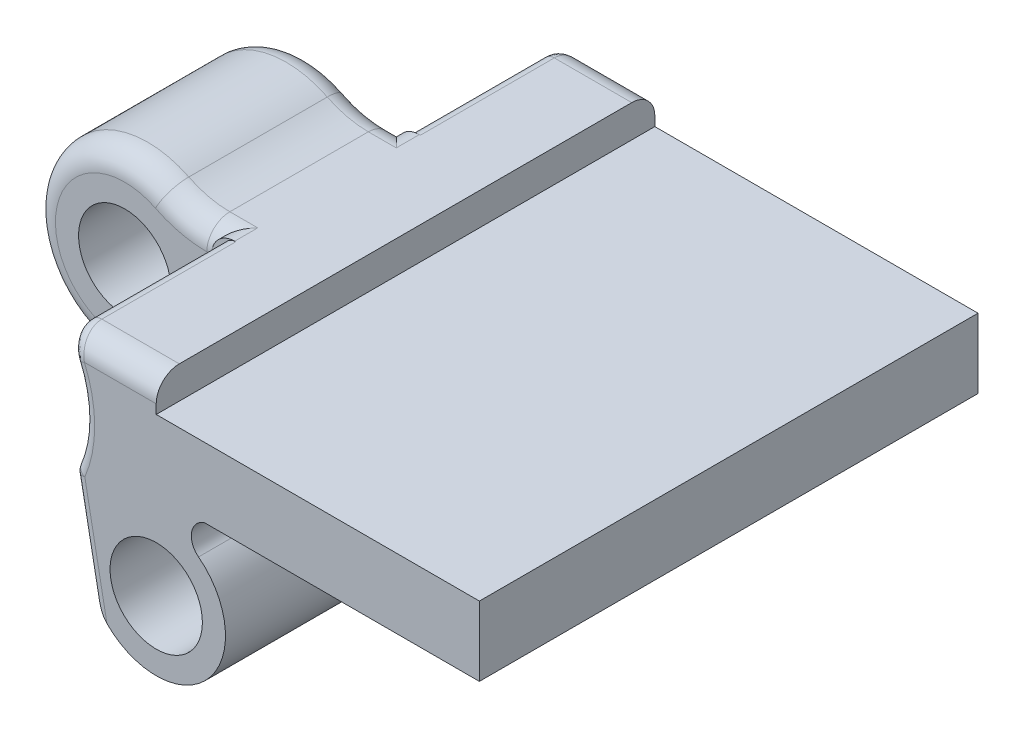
ISO-10303-21;
HEADER;
FILE_DESCRIPTION(('STEP AP214'),'2;1');
FILE_NAME('part.step','',(''),(''),'','','');
FILE_SCHEMA(('AUTOMOTIVE_DESIGN { 1 0 10303 214 1 1 1 1 }'));
ENDSEC;
DATA;
#1=APPLICATION_CONTEXT('core data for automotive mechanical design processes');
#2=APPLICATION_PROTOCOL_DEFINITION('international standard','automotive_design',2000,#1);
#3=PRODUCT_CONTEXT('',#1,'mechanical');
#4=PRODUCT('Part','Part','',(#3));
#5=PRODUCT_RELATED_PRODUCT_CATEGORY('part','',(#4));
#6=PRODUCT_DEFINITION_FORMATION('','',#4);
#7=PRODUCT_DEFINITION_CONTEXT('part definition',#1,'design');
#8=PRODUCT_DEFINITION('design','',#6,#7);
#9=PRODUCT_DEFINITION_SHAPE('','',#8);
#10=(LENGTH_UNIT() NAMED_UNIT(*) SI_UNIT(.MILLI.,.METRE.));
#11=(NAMED_UNIT(*) PLANE_ANGLE_UNIT() SI_UNIT($,.RADIAN.));
#12=(NAMED_UNIT(*) SI_UNIT($,.STERADIAN.) SOLID_ANGLE_UNIT());
#13=UNCERTAINTY_MEASURE_WITH_UNIT(LENGTH_MEASURE(1.E-05),#10,'distance_accuracy_value','');
#14=(GEOMETRIC_REPRESENTATION_CONTEXT(3) GLOBAL_UNCERTAINTY_ASSIGNED_CONTEXT((#13)) GLOBAL_UNIT_ASSIGNED_CONTEXT((#10,
#11,#12)) REPRESENTATION_CONTEXT('',''));
#15=CARTESIAN_POINT('',(0.,0.,0.));
#16=DIRECTION('',(0.,0.,1.));
#17=DIRECTION('',(1.,0.,0.));
#18=AXIS2_PLACEMENT_3D('',#15,#16,#17);
#19=CARTESIAN_POINT('',(88.9,57.238483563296,68.5799999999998));
#20=DIRECTION('',(-1.,0.,0.));
#21=DIRECTION('',(0.,0.,1.));
#22=AXIS2_PLACEMENT_3D('',#19,#20,#21);
#23=PLANE('',#22);
#24=DIRECTION('',(0.,0.,-1.));
#25=VECTOR('',#24,1.);
#26=CARTESIAN_POINT('',(88.9,43.207436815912,68.5799999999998));
#27=LINE('',#26,#25);
#28=CARTESIAN_POINT('',(88.9,43.207436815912,68.5799999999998));
#29=VERTEX_POINT('',#28);
#30=CARTESIAN_POINT('',(88.9,43.2074368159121,-68.5800000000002));
#31=VERTEX_POINT('',#30);
#32=EDGE_CURVE('E265',#29,#31,#27,.T.);
#33=ORIENTED_EDGE('',*,*,#32,.F.);
#34=DIRECTION('',(0.,-0.999999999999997,0.));
#35=VECTOR('',#34,1.);
#36=CARTESIAN_POINT('',(88.9000000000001,24.0627468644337,68.5799999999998));
#37=LINE('',#36,#35);
#38=CARTESIAN_POINT('',(88.9000000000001,24.0627468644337,68.5799999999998));
#39=VERTEX_POINT('',#38);
#40=EDGE_CURVE('E292',#29,#39,#37,.T.);
#41=ORIENTED_EDGE('',*,*,#40,.T.);
#42=DIRECTION('',(0.,0.,-1.));
#43=VECTOR('',#42,1.);
#44=CARTESIAN_POINT('',(88.9000000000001,24.0627468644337,68.5799999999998));
#45=LINE('',#44,#43);
#46=CARTESIAN_POINT('',(88.9000000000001,24.0627468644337,-68.5800000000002));
#47=VERTEX_POINT('',#46);
#48=EDGE_CURVE('E285',#39,#47,#45,.T.);
#49=ORIENTED_EDGE('',*,*,#48,.T.);
#50=DIRECTION('',(0.,-0.999999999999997,0.));
#51=VECTOR('',#50,1.);
#52=CARTESIAN_POINT('',(88.9000000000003,31.9887599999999,-68.5800000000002));
#53=LINE('',#52,#51);
#54=EDGE_CURVE('E279',#31,#47,#53,.T.);
#55=ORIENTED_EDGE('',*,*,#54,.F.);
#56=EDGE_LOOP('',(#33,#41,#49,#55));
#57=FACE_BOUND('',#56,.T.);
#58=ADVANCED_FACE('F34',(#57),#23,.F.);
#59=CARTESIAN_POINT('',(14.7712670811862,19.1413249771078,68.58));
#60=DIRECTION('',(0.,0.,-1.));
#61=DIRECTION('',(-1.,0.,0.));
#62=AXIS2_PLACEMENT_3D('',#59,#60,#61);
#63=CYLINDRICAL_SURFACE('',#62,5.12810275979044);
#64=CARTESIAN_POINT('',(14.7712670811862,19.1413249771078,-6.27));
#65=DIRECTION('',(0.,0.,1.));
#66=DIRECTION('',(1.,0.,0.));
#67=AXIS2_PLACEMENT_3D('',#64,#65,#66);
#68=CIRCLE('',#67,5.12810275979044);
#69=CARTESIAN_POINT('',(11.6383258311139,15.0815076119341,-6.27));
#70=VERTEX_POINT('',#69);
#71=CARTESIAN_POINT('',(13.3300715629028,24.0627468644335,-6.27));
#72=VERTEX_POINT('',#71);
#73=EDGE_CURVE('E303',#70,#72,#68,.F.);
#74=ORIENTED_EDGE('',*,*,#73,.F.);
#75=DIRECTION('',(0.,0.,-1.));
#76=VECTOR('',#75,1.);
#77=CARTESIAN_POINT('',(11.6383258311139,15.0815076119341,68.58));
#78=LINE('',#77,#76);
#79=CARTESIAN_POINT('',(11.6383258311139,15.0815076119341,-68.58));
#80=VERTEX_POINT('',#79);
#81=EDGE_CURVE('E379',#70,#80,#78,.T.);
#82=ORIENTED_EDGE('',*,*,#81,.T.);
#83=CARTESIAN_POINT('',(14.7712670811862,19.1413249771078,-68.58));
#84=DIRECTION('',(0.,0.,-1.));
#85=DIRECTION('',(-1.,0.,0.));
#86=AXIS2_PLACEMENT_3D('',#83,#84,#85);
#87=CIRCLE('',#86,5.12810275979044);
#88=CARTESIAN_POINT('',(13.3300715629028,24.0627468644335,-68.58));
#89=VERTEX_POINT('',#88);
#90=EDGE_CURVE('E368',#80,#89,#87,.T.);
#91=ORIENTED_EDGE('',*,*,#90,.T.);
#92=DIRECTION('',(0.,0.,-1.));
#93=VECTOR('',#92,1.);
#94=CARTESIAN_POINT('',(13.3300715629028,24.0627468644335,68.58));
#95=LINE('',#94,#93);
#96=EDGE_CURVE('E375',#72,#89,#95,.T.);
#97=ORIENTED_EDGE('',*,*,#96,.F.);
#98=EDGE_LOOP('',(#74,#82,#91,#97));
#99=FACE_BOUND('',#98,.T.);
#100=ADVANCED_FACE('F584',(#99),#63,.F.);
#101=CARTESIAN_POINT('',(-51.8464800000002,31.98876,68.58));
#102=DIRECTION('',(0.,0.,1.));
#103=DIRECTION('',(1.,0.,0.));
#104=AXIS2_PLACEMENT_3D('',#101,#102,#103);
#105=PLANE('',#104);
#106=DIRECTION('',(0.,0.999999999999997,0.));
#107=VECTOR('',#106,1.);
#108=CARTESIAN_POINT('',(0.,43.207436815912,68.58));
#109=LINE('',#108,#107);
#110=CARTESIAN_POINT('',(0.,43.207436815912,68.58));
#111=VERTEX_POINT('',#110);
#112=CARTESIAN_POINT('',(0.,45.7474368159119,68.58));
#113=VERTEX_POINT('',#112);
#114=EDGE_CURVE('E1115',#111,#113,#109,.T.);
#115=ORIENTED_EDGE('',*,*,#114,.T.);
#116=DIRECTION('',(-1.,0.,0.));
#117=VECTOR('',#116,1.);
#118=CARTESIAN_POINT('',(-29.272150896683,45.7474368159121,68.58));
#119=LINE('',#118,#117);
#120=CARTESIAN_POINT('',(-19.7457878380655,45.7474368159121,68.58));
#121=VERTEX_POINT('',#120);
#122=EDGE_CURVE('E437',#113,#121,#119,.T.);
#123=ORIENTED_EDGE('',*,*,#122,.T.);
#124=CARTESIAN_POINT('',(-51.8464800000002,31.98876,68.58));
#125=DIRECTION('',(0.,0.,1.));
#126=DIRECTION('',(1.,0.,0.));
#127=AXIS2_PLACEMENT_3D('',#124,#125,#126);
#128=CIRCLE('',#127,34.925);
#129=CARTESIAN_POINT('',(-19.6334992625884,18.4950764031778,68.58));
#130=VERTEX_POINT('',#129);
#131=EDGE_CURVE('E772',#121,#130,#128,.F.);
#132=ORIENTED_EDGE('',*,*,#131,.T.);
#133=DIRECTION('',(-0.187281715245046,0.982306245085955,0.));
#134=VECTOR('',#133,1.);
#135=CARTESIAN_POINT('',(-15.2772182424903,-4.35393502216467,68.58));
#136=LINE('',#135,#134);
#137=CARTESIAN_POINT('',(-13.5554398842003,-13.3847879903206,68.58));
#138=VERTEX_POINT('',#137);
#139=EDGE_CURVE('E622',#130,#138,#136,.F.);
#140=ORIENTED_EDGE('',*,*,#139,.T.);
#141=CARTESIAN_POINT('',(0.,0.,68.58));
#142=DIRECTION('',(0.,0.,1.));
#143=DIRECTION('',(1.,0.,0.));
#144=AXIS2_PLACEMENT_3D('',#141,#142,#143);
#145=CIRCLE('',#144,19.05);
#146=CARTESIAN_POINT('',(11.6383258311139,15.0815076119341,68.58));
#147=VERTEX_POINT('',#146);
#148=EDGE_CURVE('E357',#138,#147,#145,.T.);
#149=ORIENTED_EDGE('',*,*,#148,.T.);
#150=CARTESIAN_POINT('',(14.7712670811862,19.1413249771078,68.58));
#151=DIRECTION('',(0.,0.,-1.));
#152=DIRECTION('',(-1.,0.,0.));
#153=AXIS2_PLACEMENT_3D('',#150,#151,#152);
#154=CIRCLE('',#153,5.12810275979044);
#155=CARTESIAN_POINT('',(13.3300715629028,24.0627468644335,68.58));
#156=VERTEX_POINT('',#155);
#157=EDGE_CURVE('E359',#147,#156,#154,.T.);
#158=ORIENTED_EDGE('',*,*,#157,.T.);
#159=DIRECTION('',(1.,0.,0.));
#160=VECTOR('',#159,1.);
#161=CARTESIAN_POINT('',(13.3300715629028,24.0627468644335,68.58));
#162=LINE('',#161,#160);
#163=EDGE_CURVE('E362',#156,#39,#162,.T.);
#164=ORIENTED_EDGE('',*,*,#163,.T.);
#165=ORIENTED_EDGE('',*,*,#40,.F.);
#166=DIRECTION('',(1.,0.,0.));
#167=VECTOR('',#166,1.);
#168=CARTESIAN_POINT('',(88.9,43.207436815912,68.5799999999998));
#169=LINE('',#168,#167);
#170=EDGE_CURVE('E49',#111,#29,#169,.T.);
#171=ORIENTED_EDGE('',*,*,#170,.F.);
#172=EDGE_LOOP('',(#115,#123,#132,#140,#149,#158,#164,#165,#171));
#173=FACE_BOUND('',#172,.T.);
#174=CARTESIAN_POINT('',(0.,0.,68.58));
#175=DIRECTION('',(0.,0.,1.));
#176=DIRECTION('',(1.,0.,0.));
#177=AXIS2_PLACEMENT_3D('',#174,#175,#176);
#178=CIRCLE('',#177,12.7);
#179=CARTESIAN_POINT('',(12.7,0.,68.58));
#180=VERTEX_POINT('',#179);
#181=EDGE_CURVE('E350',#180,#180,#178,.T.);
#182=ORIENTED_EDGE('',*,*,#181,.F.);
#183=EDGE_LOOP('',(#182));
#184=FACE_BOUND('',#183,.T.);
#185=ADVANCED_FACE('F589',(#173,#184),#105,.T.);
#186=CARTESIAN_POINT('',(-29.2721508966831,52.097436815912,25.4000000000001));
#187=DIRECTION('',(0.982306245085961,0.187281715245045,0.));
#188=DIRECTION('',(-0.187281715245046,0.982306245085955,0.));
#189=AXIS2_PLACEMENT_3D('',#186,#187,#188);
#190=PLANE('',#189);
#191=DIRECTION('',(-0.187281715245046,0.982306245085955,0.));
#192=VECTOR('',#191,1.);
#193=CARTESIAN_POINT('',(-27.8347563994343,44.5581979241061,65.405));
#194=LINE('',#193,#192);
#195=CARTESIAN_POINT('',(-18.3960405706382,-4.94855446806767,65.405));
#196=VERTEX_POINT('',#195);
#197=CARTESIAN_POINT('',(-22.7523215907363,17.9004569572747,65.405));
#198=VERTEX_POINT('',#197);
#199=EDGE_CURVE('E628',#196,#198,#194,.T.);
#200=ORIENTED_EDGE('',*,*,#199,.T.);
#201=DIRECTION('',(0.,0.,1.));
#202=VECTOR('',#201,1.);
#203=CARTESIAN_POINT('',(-22.7523215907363,17.9004569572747,25.4000000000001));
#204=LINE('',#203,#202);
#205=CARTESIAN_POINT('',(-22.7523215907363,17.9004569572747,25.4000000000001));
#206=VERTEX_POINT('',#205);
#207=EDGE_CURVE('E767',#198,#206,#204,.F.);
#208=ORIENTED_EDGE('',*,*,#207,.T.);
#209=DIRECTION('',(-0.187281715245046,0.982306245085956,0.));
#210=VECTOR('',#209,1.);
#211=CARTESIAN_POINT('',(-29.2721508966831,52.097436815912,25.4000000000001));
#212=LINE('',#211,#210);
#213=CARTESIAN_POINT('',(-18.3960405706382,-4.94855446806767,25.4));
#214=VERTEX_POINT('',#213);
#215=EDGE_CURVE('E343',#214,#206,#212,.T.);
#216=ORIENTED_EDGE('',*,*,#215,.F.);
#217=DIRECTION('',(0.,0.,1.));
#218=VECTOR('',#217,1.);
#219=CARTESIAN_POINT('',(-18.3960405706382,-4.94855446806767,25.4));
#220=LINE('',#219,#218);
#221=EDGE_CURVE('E346',#214,#196,#220,.T.);
#222=ORIENTED_EDGE('',*,*,#221,.T.);
#223=EDGE_LOOP('',(#200,#208,#216,#222));
#224=FACE_BOUND('',#223,.T.);
#225=ADVANCED_FACE('F872',(#224),#190,.F.);
#226=CARTESIAN_POINT('',(-51.8464800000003,45.747436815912,62.2300000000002));
#227=DIRECTION('',(1.,0.,0.));
#228=DIRECTION('',(0.,0.,-1.));
#229=AXIS2_PLACEMENT_3D('',#226,#227,#228);
#230=CYLINDRICAL_SURFACE('',#229,6.35);
#231=CARTESIAN_POINT('',(0.,45.7474368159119,62.23));
#232=DIRECTION('',(-1.,0.,0.));
#233=DIRECTION('',(0.,0.,1.));
#234=AXIS2_PLACEMENT_3D('',#231,#232,#233);
#235=CIRCLE('',#234,6.35);
#236=CARTESIAN_POINT('',(0.,52.0974368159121,62.23));
#237=VERTEX_POINT('',#236);
#238=EDGE_CURVE('E1114',#237,#113,#235,.F.);
#239=ORIENTED_EDGE('',*,*,#238,.F.);
#240=DIRECTION('',(-1.,0.,0.));
#241=VECTOR('',#240,1.);
#242=CARTESIAN_POINT('',(101.6,52.0974368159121,62.2299999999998));
#243=LINE('',#242,#241);
#244=CARTESIAN_POINT('',(-21.3013295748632,52.097436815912,62.23));
#245=VERTEX_POINT('',#244);
#246=EDGE_CURVE('E392',#245,#237,#243,.F.);
#247=ORIENTED_EDGE('',*,*,#246,.F.);
#248=CARTESIAN_POINT('',(-24.0038759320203,47.248245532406,61.2711645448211));
#249=CARTESIAN_POINT('',(-24.8098299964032,48.7187970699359,60.6653851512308));
#250=CARTESIAN_POINT('',(-23.8942519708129,50.2159118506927,60.3500810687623));
#251=CARTESIAN_POINT('',(-22.9786739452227,51.7130266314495,60.0347769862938));
#252=CARTESIAN_POINT('',(-21.2196155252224,51.8009513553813,60.312329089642));
#253=CARTESIAN_POINT('',(-24.0159976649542,47.2703596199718,61.3479101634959));
#254=CARTESIAN_POINT('',(-24.8336082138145,48.7594021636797,60.787418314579));
#255=CARTESIAN_POINT('',(-23.9171565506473,50.2672769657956,60.4968235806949));
#256=CARTESIAN_POINT('',(-23.0007329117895,51.7752139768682,60.2064493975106));
#257=CARTESIAN_POINT('',(-21.2329494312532,51.8496023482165,60.4658203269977));
#258=CARTESIAN_POINT('',(-24.0267233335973,47.2898704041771,61.4258402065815));
#259=CARTESIAN_POINT('',(-24.8548191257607,48.7954941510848,60.9124221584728));
#260=CARTESIAN_POINT('',(-23.9376012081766,50.3129523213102,60.6471948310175));
#261=CARTESIAN_POINT('',(-23.0204012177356,51.8304502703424,60.3821356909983));
#262=CARTESIAN_POINT('',(-21.2447476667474,51.8925260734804,60.6216804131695));
#263=CARTESIAN_POINT('',(-24.0452457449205,47.3235006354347,61.5835200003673));
#264=CARTESIAN_POINT('',(-24.891674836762,48.8580621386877,61.1672727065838));
#265=CARTESIAN_POINT('',(-23.9731106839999,50.3920892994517,60.9535827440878));
#266=CARTESIAN_POINT('',(-23.0545664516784,51.9261610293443,60.7400511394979));
#267=CARTESIAN_POINT('',(-21.2651223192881,51.9665125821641,60.9370400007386));
#268=CARTESIAN_POINT('',(-24.053042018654,47.337619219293,61.6632700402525));
#269=CARTESIAN_POINT('',(-24.9073068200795,48.8845161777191,61.2970839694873));
#270=CARTESIAN_POINT('',(-23.9881746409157,50.4255489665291,61.1096003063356));
#271=CARTESIAN_POINT('',(-23.0690514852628,51.966601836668,60.9222302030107));
#272=CARTESIAN_POINT('',(-21.2736982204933,51.9975734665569,61.096540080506));
#273=CARTESIAN_POINT('',(-24.0655538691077,47.3602532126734,61.823874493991));
#274=CARTESIAN_POINT('',(-24.9324916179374,48.9270804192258,61.559912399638));
#275=CARTESIAN_POINT('',(-24.0124337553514,50.4793560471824,61.4253430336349));
#276=CARTESIAN_POINT('',(-23.0923845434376,52.031650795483,61.2908901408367));
#277=CARTESIAN_POINT('',(-21.2874612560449,52.0473682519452,61.4177489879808));
#278=CARTESIAN_POINT('',(-24.0702748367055,47.368778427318,61.9047267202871));
#279=CARTESIAN_POINT('',(-24.9420462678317,48.9431937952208,61.6928801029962));
#280=CARTESIAN_POINT('',(-24.0216391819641,50.4997264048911,61.5850611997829));
#281=CARTESIAN_POINT('',(-23.1012342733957,52.0562638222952,61.4773018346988));
#282=CARTESIAN_POINT('',(-21.292654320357,52.0661237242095,61.5794534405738));
#283=CARTESIAN_POINT('',(-24.0765784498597,47.3801573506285,62.067052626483));
#284=CARTESIAN_POINT('',(-24.954824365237,48.964733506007,61.9605891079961));
#285=CARTESIAN_POINT('',(-24.033945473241,50.5269451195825,61.9065195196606));
#286=CARTESIAN_POINT('',(-23.1130689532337,52.0891619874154,61.8525092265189));
#287=CARTESIAN_POINT('',(-21.2995882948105,52.0911573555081,61.9041052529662));
#288=CARTESIAN_POINT('',(-24.0781613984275,47.3830116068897,62.1485262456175));
#289=CARTESIAN_POINT('',(-24.9580437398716,48.9701529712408,62.0952817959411));
#290=CARTESIAN_POINT('',(-24.0370469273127,50.533794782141,62.0682594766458));
#291=CARTESIAN_POINT('',(-23.1160501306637,52.0974366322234,62.0412367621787));
#292=CARTESIAN_POINT('',(-21.3013295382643,52.0974367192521,62.067052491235));
#293=CARTESIAN_POINT('',(-24.078161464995,47.3830116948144,62.3115594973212));
#294=CARTESIAN_POINT('',(-24.9580439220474,48.9701532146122,62.3648599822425));
#295=CARTESIAN_POINT('',(-24.0370471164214,50.5337951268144,62.3919107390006));
#296=CARTESIAN_POINT('',(-23.1160502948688,52.0974369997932,62.4189618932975));
#297=CARTESIAN_POINT('',(-21.3013296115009,52.0974369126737,62.3931189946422));
#298=CARTESIAN_POINT('',(-24.0765752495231,47.3801515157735,62.3931191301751));
#299=CARTESIAN_POINT('',(-24.9548179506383,48.9647225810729,62.4996952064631));
#300=CARTESIAN_POINT('',(-24.033939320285,50.5269313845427,62.553822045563));
#301=CARTESIAN_POINT('',(-23.1130630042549,52.0891452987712,62.6078890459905));
#302=CARTESIAN_POINT('',(-21.2995847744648,52.0911445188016,62.5562382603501));
#303=CARTESIAN_POINT('',(-24.0702583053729,47.3687486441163,62.5556093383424));
#304=CARTESIAN_POINT('',(-24.942012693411,48.9431373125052,62.7676729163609));
#305=CARTESIAN_POINT('',(-24.0216068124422,50.4996549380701,62.8756028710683));
#306=CARTESIAN_POINT('',(-23.101203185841,52.0561775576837,62.98347345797));
#307=CARTESIAN_POINT('',(-21.2926361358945,52.066058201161,62.8812186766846));
#308=CARTESIAN_POINT('',(-24.0655274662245,47.3602057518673,62.6365398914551));
#309=CARTESIAN_POINT('',(-24.9324378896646,48.9269902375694,62.9007667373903));
#310=CARTESIAN_POINT('',(-24.012381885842,50.4792417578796,63.0354723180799));
#311=CARTESIAN_POINT('',(-23.0923348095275,52.0315130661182,63.170062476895));
#312=CARTESIAN_POINT('',(-21.2874322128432,52.0472638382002,63.0430797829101));
#313=CARTESIAN_POINT('',(-24.0530047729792,47.3375515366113,62.7971321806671));
#314=CARTESIAN_POINT('',(-24.9072324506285,48.8843898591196,63.163573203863));
#315=CARTESIAN_POINT('',(-23.9881031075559,50.4253895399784,63.3511897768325));
#316=CARTESIAN_POINT('',(-23.0689825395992,51.9664086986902,63.5386915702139));
#317=CARTESIAN_POINT('',(-21.2736572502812,51.9974245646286,63.3642643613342));
#318=CARTESIAN_POINT('',(-24.0452139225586,47.3234420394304,62.876794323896));
#319=CARTESIAN_POINT('',(-24.8916126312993,48.857954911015,63.2932433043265));
#320=CARTESIAN_POINT('',(-23.9730511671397,50.3919547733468,63.5070390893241));
#321=CARTESIAN_POINT('',(-23.0545086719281,51.9259969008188,63.7206717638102));
#322=CARTESIAN_POINT('',(-21.2650873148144,51.9663836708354,63.5235886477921));
#323=CARTESIAN_POINT('',(-24.0267012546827,47.2898311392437,63.0343041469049));
#324=CARTESIAN_POINT('',(-24.854774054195,48.7954192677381,63.5478033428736));
#325=CARTESIAN_POINT('',(-23.9375573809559,50.3128565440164,63.8130745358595));
#326=CARTESIAN_POINT('',(-23.0203595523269,51.830335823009,64.0781828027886));
#327=CARTESIAN_POINT('',(-21.2447233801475,51.8924396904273,63.8386082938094));
#328=CARTESIAN_POINT('',(-24.015979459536,47.2703297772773,63.1121518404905));
#329=CARTESIAN_POINT('',(-24.8335672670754,48.7593390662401,63.6726571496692));
#330=CARTESIAN_POINT('',(-23.9171155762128,50.2671931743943,63.9632607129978));
#331=CARTESIAN_POINT('',(-23.0006954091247,51.7751179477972,64.2536626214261));
#332=CARTESIAN_POINT('',(-21.2329294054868,51.8495366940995,63.9943036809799));
#333=CARTESIAN_POINT('',(-23.9918106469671,47.2262310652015,63.2652767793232));
#334=CARTESIAN_POINT('',(-24.786200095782,48.6784384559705,63.9160209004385));
#335=CARTESIAN_POINT('',(-23.8714606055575,50.1647925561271,64.2561137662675));
#336=CARTESIAN_POINT('',(-22.9567520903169,51.6512161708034,64.5960073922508));
#337=CARTESIAN_POINT('',(-21.2063437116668,51.7525195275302,64.3005535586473));
#338=CARTESIAN_POINT('',(-23.97837234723,47.2016500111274,63.3405613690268));
#339=CARTESIAN_POINT('',(-24.7600693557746,48.6336699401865,64.0345220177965));
#340=CARTESIAN_POINT('',(-23.8462627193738,50.1080907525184,64.3988029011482));
#341=CARTESIAN_POINT('',(-22.9325005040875,51.5826121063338,64.7628585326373));
#342=CARTESIAN_POINT('',(-21.191561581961,51.6984412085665,64.4511227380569));
#343=CARTESIAN_POINT('',(-23.948947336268,47.1476226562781,63.4883734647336));
#344=CARTESIAN_POINT('',(-24.7034439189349,48.5362057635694,64.2647263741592));
#345=CARTESIAN_POINT('',(-23.7916574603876,49.9846252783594,64.6761293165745));
#346=CARTESIAN_POINT('',(-22.8799158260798,51.4331460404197,65.0873042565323));
#347=CARTESIAN_POINT('',(-21.1591940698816,51.579581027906,64.746746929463));
#348=CARTESIAN_POINT('',(-23.9329597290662,47.1181746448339,63.5608999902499));
#349=CARTESIAN_POINT('',(-24.6729619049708,48.483532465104,64.3764094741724));
#350=CARTESIAN_POINT('',(-23.7622486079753,49.9178580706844,64.8107637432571));
#351=CARTESIAN_POINT('',(-22.8515945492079,51.3523184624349,65.2448700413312));
#352=CARTESIAN_POINT('',(-21.1416077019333,51.5147954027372,64.8917999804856));
#353=CARTESIAN_POINT('',(-23.8814865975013,47.0229494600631,63.7737379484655));
#354=CARTESIAN_POINT('',(-24.5760308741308,48.3151260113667,64.6999537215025));
#355=CARTESIAN_POINT('',(-23.6686361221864,49.704154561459,65.201357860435));
#356=CARTESIAN_POINT('',(-22.761471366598,51.0937090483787,65.7018039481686));
#357=CARTESIAN_POINT('',(-21.0849872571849,51.3052999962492,65.3174758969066));
#358=CARTESIAN_POINT('',(-23.8424790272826,46.9502699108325,63.909380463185));
#359=CARTESIAN_POINT('',(-24.5039772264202,48.1888060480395,64.9009740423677));
#360=CARTESIAN_POINT('',(-23.5990239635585,49.5437661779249,65.4441475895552));
#361=CARTESIAN_POINT('',(-22.694399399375,50.8994945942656,65.9863423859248));
#362=CARTESIAN_POINT('',(-21.0420789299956,51.1454049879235,65.5887609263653));
#363=CARTESIAN_POINT('',(-23.7545891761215,46.7846180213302,64.1725693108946));
#364=CARTESIAN_POINT('',(-24.3457328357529,47.9074110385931,65.2807525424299));
#365=CARTESIAN_POINT('',(-23.4460974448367,49.1864687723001,65.90337865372));
#366=CARTESIAN_POINT('',(-22.5468255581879,50.4663754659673,66.5249044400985));
#367=CARTESIAN_POINT('',(-20.9454000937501,50.780970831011,66.1151386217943));
#368=CARTESIAN_POINT('',(-23.7052781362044,46.6907413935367,64.2992448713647));
#369=CARTESIAN_POINT('',(-24.2590554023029,47.7512818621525,65.4577467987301));
#370=CARTESIAN_POINT('',(-23.3622361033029,48.988023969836,66.1176014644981));
#371=CARTESIAN_POINT('',(-22.4658569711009,50.2258258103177,66.7764816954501));
#372=CARTESIAN_POINT('',(-20.8911579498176,50.5744422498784,66.3684897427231));
#373=CARTESIAN_POINT('',(-23.6004079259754,46.4882398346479,64.5337801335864));
#374=CARTESIAN_POINT('',(-24.0794829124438,47.422066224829,65.7756904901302));
#375=CARTESIAN_POINT('',(-23.1883907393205,48.5696989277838,66.5028744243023));
#376=CARTESIAN_POINT('',(-22.2977387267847,49.7183902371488,67.2290818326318));
#377=CARTESIAN_POINT('',(-20.7758007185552,50.1289388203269,66.837560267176));
#378=CARTESIAN_POINT('',(-23.544846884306,46.3796104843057,64.6416341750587));
#379=CARTESIAN_POINT('',(-23.9866437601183,47.2491086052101,65.9167640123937));
#380=CARTESIAN_POINT('',(-23.0984048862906,48.349812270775,66.6739115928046));
#381=CARTESIAN_POINT('',(-22.2106431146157,49.4517038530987,67.430277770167));
#382=CARTESIAN_POINT('',(-20.714683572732,49.8899542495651,67.0532683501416));
#383=CARTESIAN_POINT('',(-23.4226264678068,46.1368195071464,64.8486500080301));
#384=CARTESIAN_POINT('',(-23.7873644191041,46.8703902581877,66.1785467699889));
#385=CARTESIAN_POINT('',(-22.9050079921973,47.8684405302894,66.9917581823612));
#386=CARTESIAN_POINT('',(-22.0232429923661,48.8679624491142,67.8039945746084));
#387=CARTESIAN_POINT('',(-20.5802411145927,49.3558140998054,67.467300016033));
#388=CARTESIAN_POINT('',(-23.3554302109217,46.0011576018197,64.9452999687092));
#389=CARTESIAN_POINT('',(-23.6805655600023,46.6631299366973,66.2952309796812));
#390=CARTESIAN_POINT('',(-22.801262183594,47.605103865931,67.1333567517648));
#391=CARTESIAN_POINT('',(-21.922551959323,48.5486186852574,67.9708160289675));
#392=CARTESIAN_POINT('',(-20.5063252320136,49.0573579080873,67.6605999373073));
#393=CARTESIAN_POINT('',(-23.2180607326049,45.718320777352,65.1119935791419));
#394=CARTESIAN_POINT('',(-23.46739823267,46.2391200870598,66.4871296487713));
#395=CARTESIAN_POINT('',(-22.5939102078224,47.0668413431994,67.3665636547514));
#396=CARTESIAN_POINT('',(-21.7210159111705,47.8961027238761,68.2453292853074));
#397=CARTESIAN_POINT('',(-20.3552188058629,48.4351168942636,67.9939871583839));
#398=CARTESIAN_POINT('',(-23.1478865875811,45.5711422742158,65.1820289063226));
#399=CARTESIAN_POINT('',(-23.3610097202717,46.0223863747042,66.5625832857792));
#400=CARTESIAN_POINT('',(-22.4903040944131,46.7919118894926,67.4581563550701));
#401=CARTESIAN_POINT('',(-21.6201549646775,47.5629506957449,68.3533621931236));
#402=CARTESIAN_POINT('',(-20.2780272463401,48.1113241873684,68.1340578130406));
#403=CARTESIAN_POINT('',(-23.0080504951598,45.2716155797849,65.2932596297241));
#404=CARTESIAN_POINT('',(-23.1533387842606,45.5879501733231,66.672556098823));
#405=CARTESIAN_POINT('',(-22.287766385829,46.2414189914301,67.5919108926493));
#406=CARTESIAN_POINT('',(-21.4227275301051,46.8963372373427,68.5109130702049));
#407=CARTESIAN_POINT('',(-20.1242075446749,47.4523654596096,68.3565192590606));
#408=CARTESIAN_POINT('',(-22.9384050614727,45.1194232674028,65.3349886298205));
#409=CARTESIAN_POINT('',(-23.0519600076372,45.3703301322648,66.7080582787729));
#410=CARTESIAN_POINT('',(-22.1887830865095,45.9659715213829,67.6349980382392));
#411=CARTESIAN_POINT('',(-21.3260830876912,46.5629736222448,68.5618361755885));
#412=CARTESIAN_POINT('',(-20.0475975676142,47.1175423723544,68.4399772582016));
#413=CARTESIAN_POINT('',(-22.8001000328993,44.8105755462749,65.3908577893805));
#414=CARTESIAN_POINT('',(-22.8541210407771,44.9338692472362,66.741750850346));
#415=CARTESIAN_POINT('',(-21.9953142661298,45.4141184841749,67.6761199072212));
#416=CARTESIAN_POINT('',(-21.1369833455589,45.8957247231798,68.6103880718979));
#417=CARTESIAN_POINT('',(-19.8954620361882,46.438077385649,68.5517155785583));
#418=CARTESIAN_POINT('',(-22.7314400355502,44.6539220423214,65.4050095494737));
#419=CARTESIAN_POINT('',(-22.7575944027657,44.7149460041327,66.7401465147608));
#420=CARTESIAN_POINT('',(-21.9008268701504,45.1377133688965,67.6741735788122));
#421=CARTESIAN_POINT('',(-21.0444672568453,45.5617063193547,68.6083101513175));
#422=CARTESIAN_POINT('',(-19.8199360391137,46.0934396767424,68.5800191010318));
#423=CARTESIAN_POINT('',(-22.5918781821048,44.3282984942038,65.4049897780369));
#424=CARTESIAN_POINT('',(-22.5643417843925,44.2640499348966,66.6987982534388));
#425=CARTESIAN_POINT('',(-21.7113245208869,44.5689317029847,67.6242566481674));
#426=CARTESIAN_POINT('',(-20.8587722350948,44.875207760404,68.5498353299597));
#427=CARTESIAN_POINT('',(-19.6664180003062,45.3770678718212,68.5799795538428));
#428=CARTESIAN_POINT('',(-22.5211589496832,44.1592379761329,65.388753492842));
#429=CARTESIAN_POINT('',(-22.4679623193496,44.032034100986,66.6565507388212));
#430=CARTESIAN_POINT('',(-21.6167409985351,44.2768011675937,67.5730545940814));
#431=CARTESIAN_POINT('',(-20.7658943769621,44.5227572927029,68.4898720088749));
#432=CARTESIAN_POINT('',(-19.5886268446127,45.005134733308,68.5475069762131));
#433=CARTESIAN_POINT('',(-22.4186153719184,43.9081375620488,65.339719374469));
#434=CARTESIAN_POINT('',(-22.3299639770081,43.6895155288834,66.5620036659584));
#435=CARTESIAN_POINT('',(-21.4812190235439,43.8463897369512,67.4587979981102));
#436=CARTESIAN_POINT('',(-20.6325687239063,44.0035650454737,68.3556733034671));
#437=CARTESIAN_POINT('',(-19.4758289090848,44.452713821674,68.449438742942));
#438=CARTESIAN_POINT('',(-22.3849740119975,43.8247251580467,65.3192103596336));
#439=CARTESIAN_POINT('',(-22.2850489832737,43.5762339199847,66.5252855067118));
#440=CARTESIAN_POINT('',(-21.4370404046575,43.7040020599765,67.4143721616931));
#441=CARTESIAN_POINT('',(-20.5891150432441,43.8320416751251,68.3035555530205));
#442=CARTESIAN_POINT('',(-19.438823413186,44.2692065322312,68.4084207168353));
#443=CARTESIAN_POINT('',(-22.3190750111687,43.6593552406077,65.2699367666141));
#444=CARTESIAN_POINT('',(-22.1976223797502,43.3523111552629,66.4415645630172));
#445=CARTESIAN_POINT('',(-21.3509828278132,43.4226916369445,67.3131065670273));
#446=CARTESIAN_POINT('',(-20.5044257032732,43.4933421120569,68.1847467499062));
#447=CARTESIAN_POINT('',(-19.3663345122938,43.9053927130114,68.3098735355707));
#448=CARTESIAN_POINT('',(-22.2868177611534,43.5773981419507,65.2411698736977));
#449=CARTESIAN_POINT('',(-22.1551001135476,43.2416484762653,66.3945722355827));
#450=CARTESIAN_POINT('',(-21.3091045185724,43.2837698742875,67.2562633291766));
#451=CARTESIAN_POINT('',(-20.4631799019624,43.3261327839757,68.1180705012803));
#452=CARTESIAN_POINT('',(-19.3308515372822,43.7250870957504,68.2523397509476));
#453=CARTESIAN_POINT('',(-22.2553432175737,43.4964584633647,65.2082824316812));
#454=CARTESIAN_POINT('',(-22.1138146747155,43.1325290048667,66.3424370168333));
#455=CARTESIAN_POINT('',(-21.2684495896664,43.1469734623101,67.1932782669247));
#456=CARTESIAN_POINT('',(-20.4230845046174,43.1614179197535,68.044119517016));
#457=CARTESIAN_POINT('',(-19.2962295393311,43.5470198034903,68.1865648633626));
#458=(BOUNDED_SURFACE() B_SPLINE_SURFACE(3,2,((#248,#249,#250,#251,#252),(#253,#254,#255,#256,
#257),(#258,#259,#260,#261,#262),(#263,#264,#265,#266,#267),(#268,#269,#270,#271,#272),(#273,
#274,#275,#276,#277),(#278,#279,#280,#281,#282),(#283,#284,#285,#286,#287),(#288,#289,#290,#291,
#292),(#293,#294,#295,#296,#297),(#298,#299,#300,#301,#302),(#303,#304,#305,#306,#307),(#308,
#309,#310,#311,#312),(#313,#314,#315,#316,#317),(#318,#319,#320,#321,#322),(#323,#324,#325,#326,
#327),(#328,#329,#330,#331,#332),(#333,#334,#335,#336,#337),(#338,#339,#340,#341,#342),(#343,
#344,#345,#346,#347),(#348,#349,#350,#351,#352),(#353,#354,#355,#356,#357),(#358,#359,#360,#361,
#362),(#363,#364,#365,#366,#367),(#368,#369,#370,#371,#372),(#373,#374,#375,#376,#377),(#378,
#379,#380,#381,#382),(#383,#384,#385,#386,#387),(#388,#389,#390,#391,#392),(#393,#394,#395,#396,
#397),(#398,#399,#400,#401,#402),(#403,#404,#405,#406,#407),(#408,#409,#410,#411,#412),(#413,
#414,#415,#416,#417),(#418,#419,#420,#421,#422),(#423,#424,#425,#426,#427),(#428,#429,#430,#431,
#432),(#433,#434,#435,#436,#437),(#438,#439,#440,#441,#442),(#443,#444,#445,#446,#447),(#448,
#449,#450,#451,#452),(#453,#454,#455,#456,#457)),.UNSPECIFIED.,.F.,.F.,
.F.) B_SPLINE_SURFACE_WITH_KNOTS((4,2,2,2,2,2,2,2,2,2,2,2,2,2,2,2,2,2,2,2,4),(3,2,3),(0.,
0.244757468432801,0.489554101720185,0.733920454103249,0.978263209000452,1.22286311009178,
1.46747160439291,1.71199993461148,1.95652640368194,2.20028026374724,2.44411998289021,
2.93156979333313,3.44614924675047,3.96088318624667,4.53612000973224,5.11153656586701,
5.67577973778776,6.23978550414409,6.84350947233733,7.14631145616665,7.44919840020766),(0.,0.5,
1.),.UNSPECIFIED.) GEOMETRIC_REPRESENTATION_ITEM() RATIONAL_B_SPLINE_SURFACE(((1.,
0.871921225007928,1.,0.871921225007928,1.),(1.,0.871322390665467,1.,0.871322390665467,1.),(1.,
0.870788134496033,1.,0.870788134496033,1.),(1.,0.869860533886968,1.,0.869860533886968,1.),(1.,
0.869467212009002,1.,0.869467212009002,1.),(1.,0.868833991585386,1.,0.868833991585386,1.),(1.,
0.868593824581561,1.,0.868593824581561,1.),(1.,0.868272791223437,1.,0.868272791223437,1.),(1.,
0.868191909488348,1.,0.868191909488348,1.),(1.,0.868191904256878,1.,0.868191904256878,1.),(1.,
0.868272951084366,1.,0.868272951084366,1.),(1.,0.868594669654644,1.,0.868594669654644,1.),(1.,
0.868835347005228,1.,0.868835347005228,1.),(1.,0.869469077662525,1.,0.869469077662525,1.),(1.,
0.869862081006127,1.,0.869862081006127,1.),(1.,0.870789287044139,1.,0.870789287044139,1.),(1.,
0.871323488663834,1.,0.871323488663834,1.),(1.,0.872517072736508,1.,0.872517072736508,1.),(1.,
0.873176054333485,1.,0.873176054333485,1.),(1.,0.874604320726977,1.,0.874604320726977,1.),(1.,
0.875373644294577,1.,0.875373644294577,1.),(1.,0.877822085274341,1.,0.877822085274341,1.),(1.,
0.879642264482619,1.,0.879642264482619,1.),(1.,0.883630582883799,1.,0.883630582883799,1.),(1.,
0.88581245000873,1.,0.88581245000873,1.),(1.,0.890309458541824,1.,0.890309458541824,1.),(1.,
0.89262463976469,1.,0.89262463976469,1.),(1.,0.897556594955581,1.,0.897556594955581,1.),(1.,
0.900176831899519,1.,0.900176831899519,1.),(1.,0.905344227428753,1.,0.905344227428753,1.),(1.,
0.907891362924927,1.,0.907891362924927,1.),(1.,0.9127900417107,1.,0.9127900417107,1.),(1.,
0.915144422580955,1.,0.915144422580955,1.),(1.,0.919662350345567,1.,0.919662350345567,1.),(1.,
0.921825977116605,1.,0.921825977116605,1.),(1.,0.926077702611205,1.,0.926077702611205,1.),(1.,
0.928149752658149,1.,0.928149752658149,1.),(1.,0.931049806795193,1.,0.931049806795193,1.),(1.,
0.931983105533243,1.,0.931983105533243,1.),(1.,0.933778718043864,1.,0.933778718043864,1.),(1.,
0.934641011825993,1.,0.934641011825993,1.),(1.,0.93546743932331,1.,0.93546743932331,1.))) REPRESENTATION_ITEM('') SURFACE());
#459=CARTESIAN_POINT('',(-21.2196155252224,51.8009513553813,60.312329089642));
#460=CARTESIAN_POINT('',(-21.2329494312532,51.8496023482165,60.4658203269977));
#461=CARTESIAN_POINT('',(-21.2447476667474,51.8925260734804,60.6216804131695));
#462=CARTESIAN_POINT('',(-21.2651223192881,51.9665125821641,60.9370400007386));
#463=CARTESIAN_POINT('',(-21.2736982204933,51.9975734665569,61.096540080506));
#464=CARTESIAN_POINT('',(-21.2874612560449,52.0473682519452,61.4177489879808));
#465=CARTESIAN_POINT('',(-21.292654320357,52.0661237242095,61.5794534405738));
#466=CARTESIAN_POINT('',(-21.2995882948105,52.0911573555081,61.9041052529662));
#467=CARTESIAN_POINT('',(-21.3013295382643,52.0974367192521,62.067052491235));
#468=CARTESIAN_POINT('',(-21.3013296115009,52.0974369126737,62.3931189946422));
#469=CARTESIAN_POINT('',(-21.2995847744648,52.0911445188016,62.5562382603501));
#470=CARTESIAN_POINT('',(-21.2926361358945,52.066058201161,62.8812186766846));
#471=CARTESIAN_POINT('',(-21.2874322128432,52.0472638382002,63.0430797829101));
#472=CARTESIAN_POINT('',(-21.2736572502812,51.9974245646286,63.3642643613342));
#473=CARTESIAN_POINT('',(-21.2650873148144,51.9663836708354,63.5235886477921));
#474=CARTESIAN_POINT('',(-21.2447233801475,51.8924396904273,63.8386082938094));
#475=CARTESIAN_POINT('',(-21.2329294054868,51.8495366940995,63.9943036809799));
#476=CARTESIAN_POINT('',(-21.2063437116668,51.7525195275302,64.3005535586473));
#477=CARTESIAN_POINT('',(-21.191561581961,51.6984412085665,64.4511227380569));
#478=CARTESIAN_POINT('',(-21.1591940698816,51.579581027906,64.746746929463));
#479=CARTESIAN_POINT('',(-21.1416077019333,51.5147954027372,64.8917999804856));
#480=CARTESIAN_POINT('',(-21.0849872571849,51.3052999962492,65.3174758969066));
#481=CARTESIAN_POINT('',(-21.0420789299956,51.1454049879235,65.5887609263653));
#482=CARTESIAN_POINT('',(-20.9454000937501,50.780970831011,66.1151386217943));
#483=CARTESIAN_POINT('',(-20.8911579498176,50.5744422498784,66.3684897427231));
#484=CARTESIAN_POINT('',(-20.7758007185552,50.1289388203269,66.837560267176));
#485=CARTESIAN_POINT('',(-20.714683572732,49.8899542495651,67.0532683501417));
#486=CARTESIAN_POINT('',(-20.5802411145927,49.3558140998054,67.467300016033));
#487=CARTESIAN_POINT('',(-20.5063252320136,49.0573579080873,67.6605999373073));
#488=CARTESIAN_POINT('',(-20.3552188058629,48.4351168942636,67.9939871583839));
#489=CARTESIAN_POINT('',(-20.2780272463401,48.1113241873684,68.1340578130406));
#490=CARTESIAN_POINT('',(-20.1242075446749,47.4523654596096,68.3565192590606));
#491=CARTESIAN_POINT('',(-20.0475975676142,47.1175423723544,68.4399772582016));
#492=CARTESIAN_POINT('',(-19.8954620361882,46.438077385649,68.5517155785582));
#493=CARTESIAN_POINT('',(-19.8199360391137,46.0934396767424,68.5800191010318));
#494=CARTESIAN_POINT('',(-19.6664180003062,45.3770678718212,68.5799795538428));
#495=CARTESIAN_POINT('',(-19.5886268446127,45.005134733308,68.5475069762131));
#496=CARTESIAN_POINT('',(-19.4758289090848,44.452713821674,68.449438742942));
#497=CARTESIAN_POINT('',(-19.438823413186,44.2692065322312,68.4084207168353));
#498=CARTESIAN_POINT('',(-19.3663345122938,43.9053927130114,68.3098735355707));
#499=CARTESIAN_POINT('',(-19.3308515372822,43.7250870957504,68.2523397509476));
#500=CARTESIAN_POINT('',(-19.2962295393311,43.5470198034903,68.1865648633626));
#501=B_SPLINE_CURVE_WITH_KNOTS('',3,(#459,#460,#461,#462,#463,#464,#465,#466,#467,#468,#469,
#470,#471,#472,#473,#474,#475,#476,#477,#478,#479,#480,#481,#482,#483,#484,#485,#486,#487,#488,
#489,#490,#491,#492,#493,#494,#495,#496,#497,#498,#499,#500),.UNSPECIFIED.,.F.,.F.,(4,2,2,2,2,2,
2,2,2,2,2,2,2,2,2,2,2,2,2,2,4),(0.,0.244757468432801,0.489554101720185,0.733920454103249,
0.978263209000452,1.22286311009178,1.46747160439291,1.71199993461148,1.95652640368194,
2.20028026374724,2.44411998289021,2.93156979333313,3.44614924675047,3.96088318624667,
4.53612000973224,5.11153656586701,5.67577973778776,6.23978550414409,6.84350947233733,
7.14631145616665,7.44919840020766),.UNSPECIFIED.);
#502=EDGE_CURVE('E761',#245,#121,#501,.T.);
#503=ORIENTED_EDGE('',*,*,#502,.T.);
#504=ORIENTED_EDGE('',*,*,#122,.F.);
#505=EDGE_LOOP('',(#239,#247,#503,#504));
#506=FACE_BOUND('',#505,.T.);
#507=ADVANCED_FACE('F466',(#506),#230,.T.);
#508=CARTESIAN_POINT('',(-21.5971117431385,45.7474368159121,25.4000000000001));
#509=DIRECTION('',(0.,0.,-1.));
#510=DIRECTION('',(-1.,0.,0.));
#511=AXIS2_PLACEMENT_3D('',#508,#509,#510);
#512=CYLINDRICAL_SURFACE('',#511,6.35);
#513=CARTESIAN_POINT('',(-21.5971117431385,45.7474368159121,25.4000000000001));
#514=DIRECTION('',(0.,0.,1.));
#515=DIRECTION('',(1.,0.,0.));
#516=AXIS2_PLACEMENT_3D('',#513,#514,#515);
#517=CIRCLE('',#516,6.35);
#518=CARTESIAN_POINT('',(-27.9471117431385,45.7474368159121,25.4000000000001));
#519=VERTEX_POINT('',#518);
#520=CARTESIAN_POINT('',(-21.5971117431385,52.0974368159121,25.4000000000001));
#521=VERTEX_POINT('',#520);
#522=EDGE_CURVE('E326',#519,#521,#517,.F.);
#523=ORIENTED_EDGE('',*,*,#522,.T.);
#524=DIRECTION('',(0.,0.,-1.));
#525=VECTOR('',#524,1.);
#526=CARTESIAN_POINT('',(-21.5971117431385,52.0974368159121,68.58));
#527=LINE('',#526,#525);
#528=CARTESIAN_POINT('',(-21.5971117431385,52.0974368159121,19.0500000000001));
#529=VERTEX_POINT('',#528);
#530=EDGE_CURVE('E387',#529,#521,#527,.F.);
#531=ORIENTED_EDGE('',*,*,#530,.F.);
#532=CARTESIAN_POINT('',(-21.5971117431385,45.7474368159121,19.0500000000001));
#533=DIRECTION('',(0.707106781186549,0.,0.707106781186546));
#534=DIRECTION('',(0.707106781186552,0.,-0.707106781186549));
#535=AXIS2_PLACEMENT_3D('',#532,#533,#534);
#536=ELLIPSE('',#535,8.98025612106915,6.35);
#537=EDGE_CURVE('E644',#519,#529,#536,.F.);
#538=ORIENTED_EDGE('',*,*,#537,.F.);
#539=EDGE_LOOP('',(#523,#531,#538));
#540=FACE_BOUND('',#539,.T.);
#541=ADVANCED_FACE('F474',(#540),#512,.T.);
#542=CARTESIAN_POINT('',(-26.1533285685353,52.6920562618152,65.405));
#543=DIRECTION('',(0.187281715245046,-0.982306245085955,0.));
#544=DIRECTION('',(0.982306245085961,0.187281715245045,0.));
#545=AXIS2_PLACEMENT_3D('',#542,#543,#544);
#546=CYLINDRICAL_SURFACE('',#545,3.175);
#547=ORIENTED_EDGE('',*,*,#139,.F.);
#548=CARTESIAN_POINT('',(-19.6334992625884,18.4950764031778,65.405));
#549=DIRECTION('',(0.187281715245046,-0.982306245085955,0.));
#550=DIRECTION('',(0.982306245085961,0.187281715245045,0.));
#551=AXIS2_PLACEMENT_3D('',#548,#549,#550);
#552=CIRCLE('',#551,3.175);
#553=EDGE_CURVE('E629',#130,#198,#552,.T.);
#554=ORIENTED_EDGE('',*,*,#553,.T.);
#555=ORIENTED_EDGE('',*,*,#199,.F.);
#556=CARTESIAN_POINT('',(-13.5554398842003,-13.3847879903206,68.58));
#557=CARTESIAN_POINT('',(-13.6499364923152,-13.2890887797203,68.5799922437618));
#558=CARTESIAN_POINT('',(-13.7433972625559,-13.1924068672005,68.5773504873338));
#559=CARTESIAN_POINT('',(-13.9281067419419,-12.9972450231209,68.5672411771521));
#560=CARTESIAN_POINT('',(-14.0193560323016,-12.8987655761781,68.5597749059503));
#561=CARTESIAN_POINT('',(-14.2893697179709,-12.6011145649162,68.5308301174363));
#562=CARTESIAN_POINT('',(-14.4646953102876,-12.3994310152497,68.5028028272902));
#563=CARTESIAN_POINT('',(-14.8053050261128,-11.9906710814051,68.432221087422));
#564=CARTESIAN_POINT('',(-14.9705991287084,-11.7836003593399,68.3896813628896));
#565=CARTESIAN_POINT('',(-15.2911798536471,-11.3645039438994,68.2923739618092));
#566=CARTESIAN_POINT('',(-15.4464616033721,-11.1524759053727,68.2376003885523));
#567=CARTESIAN_POINT('',(-15.7275559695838,-10.7516732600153,68.1254260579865));
#568=CARTESIAN_POINT('',(-15.854593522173,-10.5634050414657,68.0692637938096));
#569=CARTESIAN_POINT('',(-16.1009352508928,-10.1839846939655,67.9501250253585));
#570=CARTESIAN_POINT('',(-16.2202391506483,-9.99283246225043,67.8871482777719));
#571=CARTESIAN_POINT('',(-16.4512283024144,-9.60781075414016,67.7551884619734));
#572=CARTESIAN_POINT('',(-16.5629076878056,-9.41393932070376,67.686200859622));
#573=CARTESIAN_POINT('',(-16.7785918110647,-9.02391335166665,67.5429534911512));
#574=CARTESIAN_POINT('',(-16.8825970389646,-8.82775896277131,67.4686940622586));
#575=CARTESIAN_POINT('',(-17.0830036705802,-8.43341041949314,67.3153990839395));
#576=CARTESIAN_POINT('',(-17.1794040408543,-8.23521599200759,67.2363628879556));
#577=CARTESIAN_POINT('',(-17.3646327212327,-7.83710568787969,67.0738072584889));
#578=CARTESIAN_POINT('',(-17.4534602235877,-7.63718963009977,66.9902873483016));
#579=CARTESIAN_POINT('',(-17.6234496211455,-7.23628998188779,66.8187629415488));
#580=CARTESIAN_POINT('',(-17.704618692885,-7.03530758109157,66.7307627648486));
#581=CARTESIAN_POINT('',(-17.8593056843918,-6.63280431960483,66.549495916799));
#582=CARTESIAN_POINT('',(-17.9328254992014,-6.43128360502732,66.456230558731));
#583=CARTESIAN_POINT('',(-18.0314838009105,-6.14622217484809,66.3180000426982));
#584=CARTESIAN_POINT('',(-18.0599152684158,-6.06215794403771,66.2764538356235));
#585=CARTESIAN_POINT('',(-18.1153001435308,-5.89458868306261,66.1913397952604));
#586=CARTESIAN_POINT('',(-18.142253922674,-5.81108351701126,66.1477724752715));
#587=CARTESIAN_POINT('',(-18.1857028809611,-5.67327213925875,66.0728759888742));
#588=CARTESIAN_POINT('',(-18.2026493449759,-5.61865213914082,66.0423974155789));
#589=CARTESIAN_POINT('',(-18.2357336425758,-5.51033007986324,65.9795749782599));
#590=CARTESIAN_POINT('',(-18.2518721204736,-5.45662731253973,65.9472326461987));
#591=CARTESIAN_POINT('',(-18.2885187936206,-5.33272568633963,65.868483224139));
#592=CARTESIAN_POINT('',(-18.3086728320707,-5.26304821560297,65.8210021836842));
#593=CARTESIAN_POINT('',(-18.3369105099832,-5.16347223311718,65.7420737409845));
#594=CARTESIAN_POINT('',(-18.346029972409,-5.13095875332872,65.714326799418));
#595=CARTESIAN_POINT('',(-18.3631220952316,-5.06944098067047,65.6547666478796));
#596=CARTESIAN_POINT('',(-18.3710992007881,-5.04042315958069,65.6229701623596));
#597=CARTESIAN_POINT('',(-18.3806815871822,-5.00531341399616,65.5737633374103));
#598=CARTESIAN_POINT('',(-18.383258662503,-4.9958363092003,65.559014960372));
#599=CARTESIAN_POINT('',(-18.3878473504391,-4.97891996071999,65.5283865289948));
#600=CARTESIAN_POINT('',(-18.389862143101,-4.97146926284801,65.5125135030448));
#601=CARTESIAN_POINT('',(-18.3929249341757,-4.96012550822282,65.4816612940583));
#602=CARTESIAN_POINT('',(-18.3940619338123,-4.95590550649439,65.4668159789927));
#603=CARTESIAN_POINT('',(-18.3956330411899,-4.95006963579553,65.436349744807));
#604=CARTESIAN_POINT('',(-18.3960554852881,-4.94849698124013,65.4207201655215));
#605=CARTESIAN_POINT('',(-18.3960405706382,-4.94855446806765,65.405));
#606=B_SPLINE_CURVE_WITH_KNOTS('',3,(#556,#557,#558,#559,#560,#561,#562,#563,#564,#565,#566,
#567,#568,#569,#570,#571,#572,#573,#574,#575,#576,#577,#578,#579,#580,#581,#582,#583,#584,#585,
#586,#587,#588,#589,#590,#591,#592,#593,#594,#595,#596,#597,#598,#599,#600,#601,#602,#603,#604,
#605),.UNSPECIFIED.,.F.,.F.,(4,2,2,2,2,2,2,2,2,2,2,2,2,2,2,2,2,2,2,2,2,2,2,2,4),(0.,
0.403393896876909,0.806680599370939,1.611996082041,2.41649686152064,3.22138624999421,
3.92301780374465,4.62467441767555,5.32686496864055,6.02901064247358,6.73125156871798,
7.43356730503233,8.13521824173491,8.83669493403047,9.13062978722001,9.42449039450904,
9.61885932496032,9.81307070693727,10.0725494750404,10.2035605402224,10.3340470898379,
10.3870894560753,10.4398254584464,10.486011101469,10.5329436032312),.UNSPECIFIED.);
#607=EDGE_CURVE('E480',#138,#196,#606,.T.);
#608=ORIENTED_EDGE('',*,*,#607,.F.);
#609=EDGE_LOOP('',(#547,#554,#555,#608));
#610=FACE_BOUND('',#609,.T.);
#611=ADVANCED_FACE('F469',(#610),#546,.T.);
#612=CARTESIAN_POINT('',(-51.8464800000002,31.98876,68.58));
#613=DIRECTION('',(0.,0.,-1.));
#614=DIRECTION('',(-1.,0.,0.));
#615=AXIS2_PLACEMENT_3D('',#612,#613,#614);
#616=CYLINDRICAL_SURFACE('',#615,25.4);
#617=DIRECTION('',(0.,0.,-1.));
#618=VECTOR('',#617,1.);
#619=CARTESIAN_POINT('',(-40.5593154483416,54.7430984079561,68.58));
#620=LINE('',#619,#618);
#621=CARTESIAN_POINT('',(-40.5593154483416,54.7430984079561,19.0500000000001));
#622=VERTEX_POINT('',#621);
#623=CARTESIAN_POINT('',(-40.5593154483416,54.7430984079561,-19.0499999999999));
#624=VERTEX_POINT('',#623);
#625=EDGE_CURVE('E365',#622,#624,#620,.T.);
#626=ORIENTED_EDGE('',*,*,#625,.T.);
#627=CARTESIAN_POINT('',(-51.8464800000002,31.98876,-19.0499999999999));
#628=DIRECTION('',(0.,0.,-1.));
#629=DIRECTION('',(-1.,0.,0.));
#630=AXIS2_PLACEMENT_3D('',#627,#628,#629);
#631=CIRCLE('',#630,25.4);
#632=CARTESIAN_POINT('',(-62.8578847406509,9.09970222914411,-19.0499999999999));
#633=VERTEX_POINT('',#632);
#634=EDGE_CURVE('E420',#624,#633,#631,.F.);
#635=ORIENTED_EDGE('',*,*,#634,.T.);
#636=DIRECTION('',(0.,0.,-1.));
#637=VECTOR('',#636,1.);
#638=CARTESIAN_POINT('',(-62.8578847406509,9.09970222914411,68.58));
#639=LINE('',#638,#637);
#640=CARTESIAN_POINT('',(-62.8578847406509,9.09970222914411,19.0500000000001));
#641=VERTEX_POINT('',#640);
#642=EDGE_CURVE('E385',#641,#633,#639,.T.);
#643=ORIENTED_EDGE('',*,*,#642,.F.);
#644=CARTESIAN_POINT('',(-51.8464800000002,31.98876,19.0500000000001));
#645=DIRECTION('',(0.,0.,1.));
#646=DIRECTION('',(1.,0.,0.));
#647=AXIS2_PLACEMENT_3D('',#644,#645,#646);
#648=CIRCLE('',#647,25.4);
#649=EDGE_CURVE('E418',#641,#622,#648,.F.);
#650=ORIENTED_EDGE('',*,*,#649,.T.);
#651=EDGE_LOOP('',(#626,#635,#643,#650));
#652=FACE_BOUND('',#651,.T.);
#653=ADVANCED_FACE('F473',(#652),#616,.T.);
#654=CARTESIAN_POINT('',(-62.8578847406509,9.09970222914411,68.58));
#655=DIRECTION('',(0.433519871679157,0.901144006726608,0.));
#656=DIRECTION('',(-0.901144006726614,0.433519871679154,0.));
#657=AXIS2_PLACEMENT_3D('',#654,#655,#656);
#658=PLANE('',#657);
#659=ORIENTED_EDGE('',*,*,#642,.T.);
#660=DIRECTION('',(0.901144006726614,-0.433519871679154,0.));
#661=VECTOR('',#660,1.);
#662=CARTESIAN_POINT('',(-8.25855355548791,-17.1667933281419,-19.05));
#663=LINE('',#662,#661);
#664=CARTESIAN_POINT('',(-8.25855355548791,-17.1667933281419,-19.05));
#665=VERTEX_POINT('',#664);
#666=EDGE_CURVE('E432',#633,#665,#663,.T.);
#667=ORIENTED_EDGE('',*,*,#666,.T.);
#668=DIRECTION('',(0.,0.,-1.));
#669=VECTOR('',#668,1.);
#670=CARTESIAN_POINT('',(-8.25855355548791,-17.1667933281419,68.58));
#671=LINE('',#670,#669);
#672=CARTESIAN_POINT('',(-8.25855355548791,-17.1667933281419,19.05));
#673=VERTEX_POINT('',#672);
#674=EDGE_CURVE('E383',#673,#665,#671,.T.);
#675=ORIENTED_EDGE('',*,*,#674,.F.);
#676=DIRECTION('',(0.901144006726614,-0.433519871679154,0.));
#677=VECTOR('',#676,1.);
#678=CARTESIAN_POINT('',(-62.8578847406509,9.09970222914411,19.0500000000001));
#679=LINE('',#678,#677);
#680=EDGE_CURVE('E435',#673,#641,#679,.F.);
#681=ORIENTED_EDGE('',*,*,#680,.T.);
#682=EDGE_LOOP('',(#659,#667,#675,#681));
#683=FACE_BOUND('',#682,.T.);
#684=ADVANCED_FACE('F698',(#683),#658,.F.);
#685=CARTESIAN_POINT('',(-29.272150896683,77.4974368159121,68.58));
#686=DIRECTION('',(0.,0.,-1.));
#687=DIRECTION('',(-1.,0.,0.));
#688=AXIS2_PLACEMENT_3D('',#685,#686,#687);
#689=CYLINDRICAL_SURFACE('',#688,25.4);
#690=DIRECTION('',(0.,0.,-1.));
#691=VECTOR('',#690,1.);
#692=CARTESIAN_POINT('',(-29.2721508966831,52.097436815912,68.58));
#693=LINE('',#692,#691);
#694=CARTESIAN_POINT('',(-29.2721508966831,52.097436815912,19.0500000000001));
#695=VERTEX_POINT('',#694);
#696=CARTESIAN_POINT('',(-29.272150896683,52.0974368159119,-19.05));
#697=VERTEX_POINT('',#696);
#698=EDGE_CURVE('E373',#695,#697,#693,.T.);
#699=ORIENTED_EDGE('',*,*,#698,.T.);
#700=CARTESIAN_POINT('',(-29.272150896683,77.4974368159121,-19.05));
#701=DIRECTION('',(0.,0.,-1.));
#702=DIRECTION('',(-1.,0.,0.));
#703=AXIS2_PLACEMENT_3D('',#700,#701,#702);
#704=CIRCLE('',#703,25.4);
#705=EDGE_CURVE('E406',#697,#624,#704,.T.);
#706=ORIENTED_EDGE('',*,*,#705,.T.);
#707=ORIENTED_EDGE('',*,*,#625,.F.);
#708=CARTESIAN_POINT('',(-29.272150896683,77.4974368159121,19.0500000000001));
#709=DIRECTION('',(0.,0.,1.));
#710=DIRECTION('',(1.,0.,0.));
#711=AXIS2_PLACEMENT_3D('',#708,#709,#710);
#712=CIRCLE('',#711,25.4);
#713=EDGE_CURVE('E404',#622,#695,#712,.T.);
#714=ORIENTED_EDGE('',*,*,#713,.T.);
#715=EDGE_LOOP('',(#699,#706,#707,#714));
#716=FACE_BOUND('',#715,.T.);
#717=ADVANCED_FACE('F707',(#716),#689,.F.);
#718=CARTESIAN_POINT('',(-51.8464800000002,31.98876,68.58));
#719=DIRECTION('',(0.,0.,-1.));
#720=DIRECTION('',(-1.,0.,0.));
#721=AXIS2_PLACEMENT_3D('',#718,#719,#720);
#722=CYLINDRICAL_SURFACE('',#721,12.7);
#723=CARTESIAN_POINT('',(-51.8464800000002,31.98876,25.4000000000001));
#724=DIRECTION('',(0.,0.,1.));
#725=DIRECTION('',(1.,0.,0.));
#726=AXIS2_PLACEMENT_3D('',#723,#724,#725);
#727=CIRCLE('',#726,12.7);
#728=CARTESIAN_POINT('',(-39.1464800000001,31.98876,25.4000000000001));
#729=VERTEX_POINT('',#728);
#730=EDGE_CURVE('E349',#729,#729,#727,.T.);
#731=ORIENTED_EDGE('',*,*,#730,.T.);
#732=EDGE_LOOP('',(#731));
#733=FACE_BOUND('',#732,.T.);
#734=CARTESIAN_POINT('',(-51.8464800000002,31.98876,-25.3999999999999));
#735=DIRECTION('',(0.,0.,-1.));
#736=DIRECTION('',(-1.,0.,0.));
#737=AXIS2_PLACEMENT_3D('',#734,#735,#736);
#738=CIRCLE('',#737,12.7);
#739=CARTESIAN_POINT('',(-64.5464800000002,31.98876,-25.3999999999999));
#740=VERTEX_POINT('',#739);
#741=EDGE_CURVE('E338',#740,#740,#738,.T.);
#742=ORIENTED_EDGE('',*,*,#741,.T.);
#743=EDGE_LOOP('',(#742));
#744=FACE_BOUND('',#743,.T.);
#745=ADVANCED_FACE('F1039',(#733,#744),#722,.F.);
#746=CARTESIAN_POINT('',(-51.84648,31.98876,-68.58));
#747=DIRECTION('',(0.,0.,1.));
#748=DIRECTION('',(1.,0.,0.));
#749=AXIS2_PLACEMENT_3D('',#746,#747,#748);
#750=PLANE('',#749);
#751=CARTESIAN_POINT('',(0.,0.,-68.58));
#752=DIRECTION('',(0.,0.,1.));
#753=DIRECTION('',(1.,0.,0.));
#754=AXIS2_PLACEMENT_3D('',#751,#752,#753);
#755=CIRCLE('',#754,12.7);
#756=CARTESIAN_POINT('',(12.7,0.,-68.58));
#757=VERTEX_POINT('',#756);
#758=EDGE_CURVE('E354',#757,#757,#755,.T.);
#759=ORIENTED_EDGE('',*,*,#758,.T.);
#760=EDGE_LOOP('',(#759));
#761=FACE_BOUND('',#760,.T.);
#762=DIRECTION('',(-1.,0.,0.));
#763=VECTOR('',#762,1.);
#764=CARTESIAN_POINT('',(-51.8464800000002,45.747436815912,-68.58));
#765=LINE('',#764,#763);
#766=CARTESIAN_POINT('',(-19.7457878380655,45.7474368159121,-68.58));
#767=VERTEX_POINT('',#766);
#768=CARTESIAN_POINT('',(1.38777878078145E-13,45.747436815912,-68.58));
#769=VERTEX_POINT('',#768);
#770=EDGE_CURVE('E439',#767,#769,#765,.F.);
#771=ORIENTED_EDGE('',*,*,#770,.T.);
#772=DIRECTION('',(0.,0.999999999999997,0.));
#773=VECTOR('',#772,1.);
#774=CARTESIAN_POINT('',(0.,43.207436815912,-68.58));
#775=LINE('',#774,#773);
#776=CARTESIAN_POINT('',(0.,43.207436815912,-68.58));
#777=VERTEX_POINT('',#776);
#778=EDGE_CURVE('E281',#777,#769,#775,.T.);
#779=ORIENTED_EDGE('',*,*,#778,.F.);
#780=DIRECTION('',(-1.,0.,0.));
#781=VECTOR('',#780,1.);
#782=CARTESIAN_POINT('',(88.9,43.2074368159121,-68.5800000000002));
#783=LINE('',#782,#781);
#784=EDGE_CURVE('E268',#31,#777,#783,.T.);
#785=ORIENTED_EDGE('',*,*,#784,.F.);
#786=ORIENTED_EDGE('',*,*,#54,.T.);
#787=DIRECTION('',(1.,0.,0.));
#788=VECTOR('',#787,1.);
#789=CARTESIAN_POINT('',(13.3300715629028,24.0627468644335,-68.58));
#790=LINE('',#789,#788);
#791=EDGE_CURVE('E360',#89,#47,#790,.T.);
#792=ORIENTED_EDGE('',*,*,#791,.F.);
#793=ORIENTED_EDGE('',*,*,#90,.F.);
#794=CARTESIAN_POINT('',(0.,0.,-68.58));
#795=DIRECTION('',(0.,0.,1.));
#796=DIRECTION('',(1.,0.,0.));
#797=AXIS2_PLACEMENT_3D('',#794,#795,#796);
#798=CIRCLE('',#797,19.05);
#799=CARTESIAN_POINT('',(-13.5554398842,-13.3847879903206,-68.58));
#800=VERTEX_POINT('',#799);
#801=EDGE_CURVE('E353',#800,#80,#798,.T.);
#802=ORIENTED_EDGE('',*,*,#801,.F.);
#803=DIRECTION('',(-0.187281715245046,0.982306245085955,0.));
#804=VECTOR('',#803,1.);
#805=CARTESIAN_POINT('',(-24.7159340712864,45.1528173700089,-68.58));
#806=LINE('',#805,#804);
#807=CARTESIAN_POINT('',(-19.6334992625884,18.4950764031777,-68.58));
#808=VERTEX_POINT('',#807);
#809=EDGE_CURVE('E632',#800,#808,#806,.T.);
#810=ORIENTED_EDGE('',*,*,#809,.T.);
#811=CARTESIAN_POINT('',(-51.84648,31.98876,-68.58));
#812=DIRECTION('',(0.,0.,1.));
#813=DIRECTION('',(1.,0.,0.));
#814=AXIS2_PLACEMENT_3D('',#811,#812,#813);
#815=CIRCLE('',#814,34.925);
#816=EDGE_CURVE('E770',#808,#767,#815,.T.);
#817=ORIENTED_EDGE('',*,*,#816,.T.);
#818=EDGE_LOOP('',(#771,#779,#785,#786,#792,#793,#802,#810,#817));
#819=FACE_BOUND('',#818,.T.);
#820=ADVANCED_FACE('F277',(#761,#819),#750,.F.);
#821=CARTESIAN_POINT('',(0.,0.,68.58));
#822=DIRECTION('',(0.,0.,-1.));
#823=DIRECTION('',(-1.,0.,0.));
#824=AXIS2_PLACEMENT_3D('',#821,#822,#823);
#825=CYLINDRICAL_SURFACE('',#824,19.05);
#826=DIRECTION('',(0.,0.,-1.));
#827=VECTOR('',#826,1.);
#828=CARTESIAN_POINT('',(14.265389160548,-12.6254176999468,68.58));
#829=LINE('',#828,#827);
#830=CARTESIAN_POINT('',(14.265389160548,-12.6254176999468,-6.27));
#831=VERTEX_POINT('',#830);
#832=CARTESIAN_POINT('',(14.265389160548,-12.6254176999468,6.26999999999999));
#833=VERTEX_POINT('',#832);
#834=EDGE_CURVE('E57',#831,#833,#829,.F.);
#835=ORIENTED_EDGE('',*,*,#834,.T.);
#836=CARTESIAN_POINT('',(0.,0.,6.27));
#837=DIRECTION('',(0.,0.,1.));
#838=DIRECTION('',(1.,0.,0.));
#839=AXIS2_PLACEMENT_3D('',#836,#837,#838);
#840=CIRCLE('',#839,19.05);
#841=CARTESIAN_POINT('',(11.6383258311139,15.0815076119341,6.26999999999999));
#842=VERTEX_POINT('',#841);
#843=EDGE_CURVE('E308',#833,#842,#840,.T.);
#844=ORIENTED_EDGE('',*,*,#843,.T.);
#845=EDGE_CURVE('E380',#147,#842,#78,.T.);
#846=ORIENTED_EDGE('',*,*,#845,.F.);
#847=ORIENTED_EDGE('',*,*,#148,.F.);
#848=ORIENTED_EDGE('',*,*,#607,.T.);
#849=ORIENTED_EDGE('',*,*,#221,.F.);
#850=CARTESIAN_POINT('',(0.,0.,25.4));
#851=DIRECTION('',(0.,0.,-1.));
#852=DIRECTION('',(1.,0.,0.));
#853=AXIS2_PLACEMENT_3D('',#850,#851,#852);
#854=CIRCLE('',#853,19.05);
#855=CARTESIAN_POINT('',(-18.3010746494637,-5.28896650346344,25.4));
#856=VERTEX_POINT('',#855);
#857=EDGE_CURVE('E341',#856,#214,#854,.T.);
#858=ORIENTED_EDGE('',*,*,#857,.F.);
#859=CARTESIAN_POINT('',(-18.3010746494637,-5.28896650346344,25.4));
#860=CARTESIAN_POINT('',(-18.2262358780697,-5.54803165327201,25.3999732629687));
#861=CARTESIAN_POINT('',(-18.1458826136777,-5.8053496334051,25.390459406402));
#862=CARTESIAN_POINT('',(-17.9748521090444,-6.31498550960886,25.3544886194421));
#863=CARTESIAN_POINT('',(-17.8841881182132,-6.56730934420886,25.3280532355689));
#864=CARTESIAN_POINT('',(-17.6937451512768,-7.0642960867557,25.2605075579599));
#865=CARTESIAN_POINT('',(-17.5940374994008,-7.30900145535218,25.2195057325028));
#866=CARTESIAN_POINT('',(-17.3855141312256,-7.79202393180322,25.1245151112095));
#867=CARTESIAN_POINT('',(-17.2766940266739,-8.03033788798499,25.070520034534));
#868=CARTESIAN_POINT('',(-16.9762212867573,-8.65429745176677,24.9118845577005));
#869=CARTESIAN_POINT('',(-16.7771222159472,-9.03386522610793,24.7972779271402));
#870=CARTESIAN_POINT('',(-16.3579764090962,-9.77239009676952,24.5428206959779));
#871=CARTESIAN_POINT('',(-16.1379209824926,-10.131338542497,24.4029596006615));
#872=CARTESIAN_POINT('',(-15.677668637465,-10.8300130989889,24.1020453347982));
#873=CARTESIAN_POINT('',(-15.4373629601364,-11.1696165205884,23.9408746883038));
#874=CARTESIAN_POINT('',(-14.9395673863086,-11.8271680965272,23.6020509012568));
#875=CARTESIAN_POINT('',(-14.6820780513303,-12.1451169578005,23.4243982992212));
#876=CARTESIAN_POINT('',(-14.0389614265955,-12.8896882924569,22.9778580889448));
#877=CARTESIAN_POINT('',(-13.6452523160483,-13.3053032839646,22.7021970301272));
#878=CARTESIAN_POINT('',(-12.8294487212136,-14.093605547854,22.1318397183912));
#879=CARTESIAN_POINT('',(-12.4073393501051,-14.4662700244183,21.8371334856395));
#880=CARTESIAN_POINT('',(-11.5386938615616,-15.1681271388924,21.2356717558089));
#881=CARTESIAN_POINT('',(-11.0922189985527,-15.4974222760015,20.9289469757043));
#882=CARTESIAN_POINT('',(-10.1762763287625,-16.1136692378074,20.3080925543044));
#883=CARTESIAN_POINT('',(-9.70682285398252,-16.4006470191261,19.9939675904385));
#884=CARTESIAN_POINT('',(-9.07117442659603,-16.7525492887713,19.5762058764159));
#885=CARTESIAN_POINT('',(-8.91446436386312,-16.8364605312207,19.4737999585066));
#886=CARTESIAN_POINT('',(-8.59888870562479,-16.999799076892,19.26886272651));
#887=CARTESIAN_POINT('',(-8.44002396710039,-17.0792281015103,19.166331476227));
#888=CARTESIAN_POINT('',(-8.27291324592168,-17.1598796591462,19.0592014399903));
#889=CARTESIAN_POINT('',(-8.26573447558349,-17.1633387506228,19.0546007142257));
#890=CARTESIAN_POINT('',(-8.25855355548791,-17.1667933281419,19.05));
#891=B_SPLINE_CURVE_WITH_KNOTS('',3,(#859,#860,#861,#862,#863,#864,#865,#866,#867,#868,#869,
#870,#871,#872,#873,#874,#875,#876,#877,#878,#879,#880,#881,#882,#883,#884,#885,#886,#887,#888,
#889,#890),.UNSPECIFIED.,.F.,.F.,(4,2,2,2,2,2,2,2,2,2,2,2,2,2,2,4),(0.,0.808532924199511,
1.61603836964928,2.41765263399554,3.21965517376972,4.54860601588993,5.87811039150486,
7.21527609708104,8.55239812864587,10.4558405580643,12.3602886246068,14.2601516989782,
16.1588445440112,16.7742577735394,17.3894330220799,17.4170373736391),.UNSPECIFIED.);
#892=EDGE_CURVE('E441',#856,#673,#891,.T.);
#893=ORIENTED_EDGE('',*,*,#892,.T.);
#894=ORIENTED_EDGE('',*,*,#674,.T.);
#895=CARTESIAN_POINT('',(-18.3010746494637,-5.28896650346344,-25.4));
#896=CARTESIAN_POINT('',(-18.2262358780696,-5.54803165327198,-25.3999732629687));
#897=CARTESIAN_POINT('',(-18.1458826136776,-5.80534963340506,-25.3904594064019));
#898=CARTESIAN_POINT('',(-17.9748521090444,-6.31498550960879,-25.3544886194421));
#899=CARTESIAN_POINT('',(-17.8841881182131,-6.56730934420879,-25.3280532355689));
#900=CARTESIAN_POINT('',(-17.6937451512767,-7.06429608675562,-25.2605075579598));
#901=CARTESIAN_POINT('',(-17.5940374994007,-7.3090014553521,-25.2195057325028));
#902=CARTESIAN_POINT('',(-17.3855141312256,-7.79202393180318,-25.1245151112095));
#903=CARTESIAN_POINT('',(-17.2766940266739,-8.03033788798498,-25.070520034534));
#904=CARTESIAN_POINT('',(-16.9762212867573,-8.65429745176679,-24.9118845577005));
#905=CARTESIAN_POINT('',(-16.7771222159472,-9.03386522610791,-24.7972779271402));
#906=CARTESIAN_POINT('',(-16.3579764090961,-9.7723900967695,-24.5428206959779));
#907=CARTESIAN_POINT('',(-16.1379209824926,-10.131338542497,-24.4029596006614));
#908=CARTESIAN_POINT('',(-15.6776686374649,-10.8300130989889,-24.1020453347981));
#909=CARTESIAN_POINT('',(-15.4373629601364,-11.1696165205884,-23.9408746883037));
#910=CARTESIAN_POINT('',(-14.9395673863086,-11.8271680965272,-23.6020509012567));
#911=CARTESIAN_POINT('',(-14.6820780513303,-12.1451169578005,-23.4243982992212));
#912=CARTESIAN_POINT('',(-14.0389614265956,-12.8896882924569,-22.9778580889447));
#913=CARTESIAN_POINT('',(-13.6452523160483,-13.3053032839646,-22.7021970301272));
#914=CARTESIAN_POINT('',(-12.8294487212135,-14.0936055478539,-22.1318397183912));
#915=CARTESIAN_POINT('',(-12.407339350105,-14.4662700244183,-21.8371334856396));
#916=CARTESIAN_POINT('',(-11.5386938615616,-15.1681271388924,-21.2356717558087));
#917=CARTESIAN_POINT('',(-11.0922189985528,-15.4974222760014,-20.9289469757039));
#918=CARTESIAN_POINT('',(-10.1762763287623,-16.1136692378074,-20.3080925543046));
#919=CARTESIAN_POINT('',(-9.7068228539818,-16.4006470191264,-19.9939675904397));
#920=CARTESIAN_POINT('',(-9.07117442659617,-16.7525492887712,-19.5762058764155));
#921=CARTESIAN_POINT('',(-8.91446436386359,-16.8364605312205,-19.4737999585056));
#922=CARTESIAN_POINT('',(-8.5988887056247,-16.999799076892,-19.26886272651));
#923=CARTESIAN_POINT('',(-8.4400239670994,-17.0792281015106,-19.1663314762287));
#924=CARTESIAN_POINT('',(-8.27291324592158,-17.1598796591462,-19.0592014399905));
#925=CARTESIAN_POINT('',(-8.26573447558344,-17.1633387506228,-19.0546007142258));
#926=CARTESIAN_POINT('',(-8.25855355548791,-17.1667933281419,-19.05));
#927=B_SPLINE_CURVE_WITH_KNOTS('',3,(#895,#896,#897,#898,#899,#900,#901,#902,#903,#904,#905,
#906,#907,#908,#909,#910,#911,#912,#913,#914,#915,#916,#917,#918,#919,#920,#921,#922,#923,#924,
#925,#926),.UNSPECIFIED.,.F.,.F.,(4,2,2,2,2,2,2,2,2,2,2,2,2,2,2,4),(0.,0.808532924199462,
1.6160383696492,2.41765263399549,3.21965517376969,4.54860601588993,5.87811039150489,
7.21527609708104,8.55239812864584,10.4558405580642,12.3602886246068,14.2601516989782,
16.1588445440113,16.7742577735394,17.3894330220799,17.417037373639),.UNSPECIFIED.);
#928=CARTESIAN_POINT('',(-18.3010746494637,-5.28896650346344,-25.4));
#929=VERTEX_POINT('',#928);
#930=EDGE_CURVE('E448',#665,#929,#927,.F.);
#931=ORIENTED_EDGE('',*,*,#930,.T.);
#932=CARTESIAN_POINT('',(0.,0.,-25.4));
#933=DIRECTION('',(0.,0.,-1.));
#934=DIRECTION('',(1.,0.,0.));
#935=AXIS2_PLACEMENT_3D('',#932,#933,#934);
#936=CIRCLE('',#935,19.05);
#937=CARTESIAN_POINT('',(-18.3960405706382,-4.94855446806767,-25.4));
#938=VERTEX_POINT('',#937);
#939=EDGE_CURVE('E329',#929,#938,#936,.T.);
#940=ORIENTED_EDGE('',*,*,#939,.T.);
#941=DIRECTION('',(0.,0.,-1.));
#942=VECTOR('',#941,1.);
#943=CARTESIAN_POINT('',(-18.3960405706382,-4.94855446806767,-25.4));
#944=LINE('',#943,#942);
#945=CARTESIAN_POINT('',(-18.3960405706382,-4.94855446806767,-65.405));
#946=VERTEX_POINT('',#945);
#947=EDGE_CURVE('E335',#938,#946,#944,.T.);
#948=ORIENTED_EDGE('',*,*,#947,.T.);
#949=CARTESIAN_POINT('',(-18.3960405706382,-4.94855446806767,-65.405));
#950=CARTESIAN_POINT('',(-18.396053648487,-4.94850401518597,-65.4200346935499));
#951=CARTESIAN_POINT('',(-18.3956678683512,-4.94994008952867,-65.4349926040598));
#952=CARTESIAN_POINT('',(-18.3942269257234,-4.95529291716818,-65.4641828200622));
#953=CARTESIAN_POINT('',(-18.393182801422,-4.95916876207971,-65.4784229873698));
#954=CARTESIAN_POINT('',(-18.3900456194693,-4.97079138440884,-65.5113767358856));
#955=CARTESIAN_POINT('',(-18.3877048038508,-4.97944920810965,-65.5297355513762));
#956=CARTESIAN_POINT('',(-18.3822937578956,-4.99938869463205,-65.5649665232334));
#957=CARTESIAN_POINT('',(-18.3792179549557,-5.01069038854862,-65.5818259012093));
#958=CARTESIAN_POINT('',(-18.3671018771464,-5.05501223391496,-65.6410539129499));
#959=CARTESIAN_POINT('',(-18.3566344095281,-5.09294896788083,-65.6793234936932));
#960=CARTESIAN_POINT('',(-18.3342452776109,-5.1729824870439,-65.7506446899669));
#961=CARTESIAN_POINT('',(-18.3223145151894,-5.21510495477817,-65.7836603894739));
#962=CARTESIAN_POINT('',(-18.2962162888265,-5.30597966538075,-65.8498164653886));
#963=CARTESIAN_POINT('',(-18.2819456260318,-5.3549626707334,-65.8826029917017));
#964=CARTESIAN_POINT('',(-18.2525720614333,-5.45424716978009,-65.9457349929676));
#965=CARTESIAN_POINT('',(-18.2374684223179,-5.50454981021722,-65.9760782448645));
#966=CARTESIAN_POINT('',(-18.1910589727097,-5.65677572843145,-66.0647660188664));
#967=CARTESIAN_POINT('',(-18.1587111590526,-5.75981932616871,-66.1206367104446));
#968=CARTESIAN_POINT('',(-18.0916676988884,-5.96707424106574,-66.2288131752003));
#969=CARTESIAN_POINT('',(-18.0569700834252,-6.07128647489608,-66.2811158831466));
#970=CARTESIAN_POINT('',(-17.9854369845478,-6.28002490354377,-66.3832105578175));
#971=CARTESIAN_POINT('',(-17.9486042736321,-6.38455053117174,-66.4330056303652));
#972=CARTESIAN_POINT('',(-17.8342266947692,-6.70024331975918,-66.5806588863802));
#973=CARTESIAN_POINT('',(-17.7534477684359,-6.91152435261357,-66.6757788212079));
#974=CARTESIAN_POINT('',(-17.5835284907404,-7.33305738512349,-66.8607701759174));
#975=CARTESIAN_POINT('',(-17.4943863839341,-7.54330915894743,-66.9506404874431));
#976=CARTESIAN_POINT('',(-17.3076441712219,-7.96245329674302,-67.1256090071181));
#977=CARTESIAN_POINT('',(-17.210032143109,-8.17134328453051,-67.2107002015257));
#978=CARTESIAN_POINT('',(-17.0064429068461,-8.58702283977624,-67.3757987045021));
#979=CARTESIAN_POINT('',(-16.9004664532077,-8.79381259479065,-67.4558064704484));
#980=CARTESIAN_POINT('',(-16.6805731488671,-9.20407006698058,-67.6099035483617));
#981=CARTESIAN_POINT('',(-16.5666934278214,-9.40754842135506,-67.684017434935));
#982=CARTESIAN_POINT('',(-16.330513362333,-9.81181122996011,-67.8260056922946));
#983=CARTESIAN_POINT('',(-16.2082123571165,-10.0125954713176,-67.8938795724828));
#984=CARTESIAN_POINT('',(-15.9552904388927,-10.4108980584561,-68.0223915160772));
#985=CARTESIAN_POINT('',(-15.824678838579,-10.6084197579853,-68.0830374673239));
#986=CARTESIAN_POINT('',(-15.5550260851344,-11.0000072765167,-68.1960462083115));
#987=CARTESIAN_POINT('',(-15.415986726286,-11.1940738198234,-68.2484107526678));
#988=CARTESIAN_POINT('',(-15.1432069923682,-11.5599632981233,-68.3389596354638));
#989=CARTESIAN_POINT('',(-15.0102317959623,-11.7321383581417,-68.3780212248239));
#990=CARTESIAN_POINT('',(-14.7375637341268,-12.0728750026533,-68.447048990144));
#991=CARTESIAN_POINT('',(-14.5978732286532,-12.2414378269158,-68.4770183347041));
#992=CARTESIAN_POINT('',(-14.3113817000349,-12.5751892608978,-68.5265468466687));
#993=CARTESIAN_POINT('',(-14.1645554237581,-12.7403624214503,-68.5460655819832));
#994=CARTESIAN_POINT('',(-13.9396181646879,-12.9846765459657,-68.5661087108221));
#995=CARTESIAN_POINT('',(-13.8638143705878,-13.0655825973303,-68.5712508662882));
#996=CARTESIAN_POINT('',(-13.7107211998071,-13.2261459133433,-68.5781949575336));
#997=CARTESIAN_POINT('',(-13.6334315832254,-13.3058029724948,-68.5799963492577));
#998=CARTESIAN_POINT('',(-13.5554398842,-13.3847879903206,-68.58));
#999=B_SPLINE_CURVE_WITH_KNOTS('',3,(#949,#950,#951,#952,#953,#954,#955,#956,#957,#958,#959,
#960,#961,#962,#963,#964,#965,#966,#967,#968,#969,#970,#971,#972,#973,#974,#975,#976,#977,#978,
#979,#980,#981,#982,#983,#984,#985,#986,#987,#988,#989,#990,#991,#992,#993,#994,#995,#996,#997,
#998),.UNSPECIFIED.,.F.,.F.,(4,2,2,2,2,2,2,2,2,2,2,2,2,2,2,2,2,2,2,2,2,2,2,2,4),(0.,
0.0449075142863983,0.089081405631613,0.15003011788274,0.211456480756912,0.374823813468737,
0.539263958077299,0.721041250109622,0.902982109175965,1.26759502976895,1.63251734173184,
1.99697596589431,2.7328813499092,3.46894154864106,4.20605517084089,4.94310237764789,
5.676894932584,6.410745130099,7.14378699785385,7.87667334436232,8.53946027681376,
9.20201596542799,9.86711680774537,10.2000229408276,10.5329832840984),.UNSPECIFIED.);
#1000=EDGE_CURVE('E487',#946,#800,#999,.T.);
#1001=ORIENTED_EDGE('',*,*,#1000,.T.);
#1002=ORIENTED_EDGE('',*,*,#801,.T.);
#1003=ORIENTED_EDGE('',*,*,#81,.F.);
#1004=CARTESIAN_POINT('',(0.,0.,-6.27));
#1005=DIRECTION('',(0.,0.,1.));
#1006=DIRECTION('',(1.,0.,0.));
#1007=AXIS2_PLACEMENT_3D('',#1004,#1005,#1006);
#1008=CIRCLE('',#1007,19.05);
#1009=EDGE_CURVE('E299',#831,#70,#1008,.T.);
#1010=ORIENTED_EDGE('',*,*,#1009,.F.);
#1011=EDGE_LOOP('',(#835,#844,#846,#847,#848,#849,#858,#893,#894,#931,#940,#948,#1001,#1002,
#1003,#1010));
#1012=FACE_BOUND('',#1011,.T.);
#1013=ADVANCED_FACE('F454',(#1012),#825,.T.);
#1014=ORIENTED_EDGE('',*,*,#845,.T.);
#1015=CARTESIAN_POINT('',(14.7712670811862,19.1413249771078,6.26999999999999));
#1016=DIRECTION('',(0.,0.,1.));
#1017=DIRECTION('',(1.,0.,0.));
#1018=AXIS2_PLACEMENT_3D('',#1015,#1016,#1017);
#1019=CIRCLE('',#1018,5.12810275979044);
#1020=CARTESIAN_POINT('',(13.3300715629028,24.0627468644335,6.26999999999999));
#1021=VERTEX_POINT('',#1020);
#1022=EDGE_CURVE('E311',#842,#1021,#1019,.F.);
#1023=ORIENTED_EDGE('',*,*,#1022,.T.);
#1024=EDGE_CURVE('E376',#156,#1021,#95,.T.);
#1025=ORIENTED_EDGE('',*,*,#1024,.F.);
#1026=ORIENTED_EDGE('',*,*,#157,.F.);
#1027=EDGE_LOOP('',(#1014,#1023,#1025,#1026));
#1028=FACE_BOUND('',#1027,.T.);
#1029=ADVANCED_FACE('F591',(#1028),#63,.F.);
#1030=CARTESIAN_POINT('',(13.3300715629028,24.0627468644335,68.58));
#1031=DIRECTION('',(0.,0.999999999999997,0.));
#1032=DIRECTION('',(0.,0.,1.));
#1033=AXIS2_PLACEMENT_3D('',#1030,#1031,#1032);
#1034=PLANE('',#1033);
#1035=ORIENTED_EDGE('',*,*,#791,.T.);
#1036=ORIENTED_EDGE('',*,*,#48,.F.);
#1037=ORIENTED_EDGE('',*,*,#163,.F.);
#1038=ORIENTED_EDGE('',*,*,#1024,.T.);
#1039=DIRECTION('',(1.,0.,0.));
#1040=VECTOR('',#1039,1.);
#1041=CARTESIAN_POINT('',(13.3300715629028,24.0627468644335,6.26999999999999));
#1042=LINE('',#1041,#1040);
#1043=CARTESIAN_POINT('',(71.1782110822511,24.0627468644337,6.2699999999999));
#1044=VERTEX_POINT('',#1043);
#1045=EDGE_CURVE('E302',#1021,#1044,#1042,.T.);
#1046=ORIENTED_EDGE('',*,*,#1045,.T.);
#1047=DIRECTION('',(0.,0.,-1.));
#1048=VECTOR('',#1047,1.);
#1049=CARTESIAN_POINT('',(71.1782110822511,24.0627468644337,68.58));
#1050=LINE('',#1049,#1048);
#1051=CARTESIAN_POINT('',(71.1782110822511,24.0627468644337,-6.27000000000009));
#1052=VERTEX_POINT('',#1051);
#1053=EDGE_CURVE('E310',#1044,#1052,#1050,.T.);
#1054=ORIENTED_EDGE('',*,*,#1053,.T.);
#1055=DIRECTION('',(1.,0.,0.));
#1056=VECTOR('',#1055,1.);
#1057=CARTESIAN_POINT('',(13.3300715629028,24.0627468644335,-6.27));
#1058=LINE('',#1057,#1056);
#1059=EDGE_CURVE('E297',#72,#1052,#1058,.T.);
#1060=ORIENTED_EDGE('',*,*,#1059,.F.);
#1061=ORIENTED_EDGE('',*,*,#96,.T.);
#1062=EDGE_LOOP('',(#1035,#1036,#1037,#1038,#1046,#1054,#1060,#1061));
#1063=FACE_BOUND('',#1062,.T.);
#1064=ADVANCED_FACE('F1050',(#1063),#1034,.F.);
#1065=CARTESIAN_POINT('',(101.6,52.0974368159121,68.5799999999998));
#1066=DIRECTION('',(0.,-0.999999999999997,0.));
#1067=DIRECTION('',(0.,0.,-1.));
#1068=AXIS2_PLACEMENT_3D('',#1065,#1066,#1067);
#1069=PLANE('',#1068);
#1070=ORIENTED_EDGE('',*,*,#246,.T.);
#1071=DIRECTION('',(0.,0.,1.));
#1072=VECTOR('',#1071,1.);
#1073=CARTESIAN_POINT('',(0.,52.0974368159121,68.58));
#1074=LINE('',#1073,#1072);
#1075=CARTESIAN_POINT('',(0.,52.0974368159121,-62.23));
#1076=VERTEX_POINT('',#1075);
#1077=EDGE_CURVE('E273',#1076,#237,#1074,.T.);
#1078=ORIENTED_EDGE('',*,*,#1077,.F.);
#1079=DIRECTION('',(-1.,0.,0.));
#1080=VECTOR('',#1079,1.);
#1081=CARTESIAN_POINT('',(101.6,52.0974368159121,-62.23));
#1082=LINE('',#1081,#1080);
#1083=CARTESIAN_POINT('',(-21.3013295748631,52.097436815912,-62.23));
#1084=VERTEX_POINT('',#1083);
#1085=EDGE_CURVE('E399',#1076,#1084,#1082,.T.);
#1086=ORIENTED_EDGE('',*,*,#1085,.T.);
#1087=DIRECTION('',(0.,0.,1.));
#1088=VECTOR('',#1087,1.);
#1089=CARTESIAN_POINT('',(-21.3013295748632,52.097436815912,68.58));
#1090=LINE('',#1089,#1088);
#1091=CARTESIAN_POINT('',(-21.3013295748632,52.097436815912,-25.3999999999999));
#1092=VERTEX_POINT('',#1091);
#1093=EDGE_CURVE('E737',#1084,#1092,#1090,.T.);
#1094=ORIENTED_EDGE('',*,*,#1093,.T.);
#1095=DIRECTION('',(-1.,0.,0.));
#1096=VECTOR('',#1095,1.);
#1097=CARTESIAN_POINT('',(0.,52.0974368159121,-25.4));
#1098=LINE('',#1097,#1096);
#1099=CARTESIAN_POINT('',(-21.5971117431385,52.0974368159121,-25.3999999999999));
#1100=VERTEX_POINT('',#1099);
#1101=EDGE_CURVE('E676',#1092,#1100,#1098,.T.);
#1102=ORIENTED_EDGE('',*,*,#1101,.T.);
#1103=DIRECTION('',(0.,0.,-1.));
#1104=VECTOR('',#1103,1.);
#1105=CARTESIAN_POINT('',(-21.5971117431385,52.0974368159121,-25.3999999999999));
#1106=LINE('',#1105,#1104);
#1107=CARTESIAN_POINT('',(-21.5971117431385,52.0974368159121,-19.05));
#1108=VERTEX_POINT('',#1107);
#1109=EDGE_CURVE('E397',#1100,#1108,#1106,.F.);
#1110=ORIENTED_EDGE('',*,*,#1109,.T.);
#1111=DIRECTION('',(-1.,0.,0.));
#1112=VECTOR('',#1111,1.);
#1113=CARTESIAN_POINT('',(-40.5593154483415,52.097436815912,-19.0499999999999));
#1114=LINE('',#1113,#1112);
#1115=EDGE_CURVE('E401',#1108,#697,#1114,.T.);
#1116=ORIENTED_EDGE('',*,*,#1115,.T.);
#1117=ORIENTED_EDGE('',*,*,#698,.F.);
#1118=DIRECTION('',(-1.,0.,0.));
#1119=VECTOR('',#1118,1.);
#1120=CARTESIAN_POINT('',(-29.2721508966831,52.097436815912,19.0500000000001));
#1121=LINE('',#1120,#1119);
#1122=EDGE_CURVE('E395',#695,#529,#1121,.F.);
#1123=ORIENTED_EDGE('',*,*,#1122,.T.);
#1124=ORIENTED_EDGE('',*,*,#530,.T.);
#1125=DIRECTION('',(1.,0.,0.));
#1126=VECTOR('',#1125,1.);
#1127=CARTESIAN_POINT('',(0.,52.0974368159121,25.4));
#1128=LINE('',#1127,#1126);
#1129=CARTESIAN_POINT('',(-21.3013295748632,52.097436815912,25.4000000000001));
#1130=VERTEX_POINT('',#1129);
#1131=EDGE_CURVE('E721',#521,#1130,#1128,.T.);
#1132=ORIENTED_EDGE('',*,*,#1131,.T.);
#1133=DIRECTION('',(0.,0.,1.));
#1134=VECTOR('',#1133,1.);
#1135=CARTESIAN_POINT('',(-21.3013295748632,52.097436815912,64.4091171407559));
#1136=LINE('',#1135,#1134);
#1137=EDGE_CURVE('E728',#1130,#245,#1136,.T.);
#1138=ORIENTED_EDGE('',*,*,#1137,.T.);
#1139=EDGE_LOOP('',(#1070,#1078,#1086,#1094,#1102,#1110,#1116,#1117,#1123,#1124,#1132,#1138));
#1140=FACE_BOUND('',#1139,.T.);
#1141=ADVANCED_FACE('F670',(#1140),#1069,.F.);
#1142=CARTESIAN_POINT('',(0.,0.,68.58));
#1143=DIRECTION('',(0.,0.,-1.));
#1144=DIRECTION('',(-1.,0.,0.));
#1145=AXIS2_PLACEMENT_3D('',#1142,#1143,#1144);
#1146=CYLINDRICAL_SURFACE('',#1145,12.7);
#1147=ORIENTED_EDGE('',*,*,#181,.T.);
#1148=EDGE_LOOP('',(#1147));
#1149=FACE_BOUND('',#1148,.T.);
#1150=ORIENTED_EDGE('',*,*,#758,.F.);
#1151=EDGE_LOOP('',(#1150));
#1152=FACE_BOUND('',#1151,.T.);
#1153=ADVANCED_FACE('F892',(#1149,#1152),#1146,.F.);
#1154=CARTESIAN_POINT('',(0.,0.,25.4));
#1155=DIRECTION('',(0.,0.,1.));
#1156=DIRECTION('',(1.,0.,0.));
#1157=AXIS2_PLACEMENT_3D('',#1154,#1155,#1156);
#1158=PLANE('',#1157);
#1159=ORIENTED_EDGE('',*,*,#215,.T.);
#1160=CARTESIAN_POINT('',(-19.6334992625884,18.4950764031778,25.4));
#1161=DIRECTION('',(0.,0.,1.));
#1162=DIRECTION('',(1.,0.,0.));
#1163=AXIS2_PLACEMENT_3D('',#1160,#1161,#1162);
#1164=CIRCLE('',#1163,3.175);
#1165=CARTESIAN_POINT('',(-22.5619520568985,19.7217749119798,25.4000000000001));
#1166=VERTEX_POINT('',#1165);
#1167=EDGE_CURVE('E42',#206,#1166,#1164,.F.);
#1168=ORIENTED_EDGE('',*,*,#1167,.T.);
#1169=CARTESIAN_POINT('',(-51.8464800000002,31.98876,25.4000000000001));
#1170=DIRECTION('',(0.,0.,1.));
#1171=DIRECTION('',(1.,0.,0.));
#1172=AXIS2_PLACEMENT_3D('',#1169,#1170,#1171);
#1173=CIRCLE('',#1172,31.75);
#1174=CARTESIAN_POINT('',(-24.0781614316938,47.383011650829,25.4000000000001));
#1175=VERTEX_POINT('',#1174);
#1176=EDGE_CURVE('E323',#1166,#1175,#1173,.T.);
#1177=ORIENTED_EDGE('',*,*,#1176,.T.);
#1178=CARTESIAN_POINT('',(-21.3013295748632,48.9224368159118,25.4000000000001));
#1179=DIRECTION('',(0.,0.,1.));
#1180=DIRECTION('',(1.,0.,0.));
#1181=AXIS2_PLACEMENT_3D('',#1178,#1179,#1180);
#1182=CIRCLE('',#1181,3.175);
#1183=EDGE_CURVE('E725',#1175,#1130,#1182,.F.);
#1184=ORIENTED_EDGE('',*,*,#1183,.T.);
#1185=ORIENTED_EDGE('',*,*,#1131,.F.);
#1186=ORIENTED_EDGE('',*,*,#522,.F.);
#1187=DIRECTION('',(-1.,0.,0.));
#1188=VECTOR('',#1187,1.);
#1189=CARTESIAN_POINT('',(-40.5593154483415,45.7474368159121,25.4000000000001));
#1190=LINE('',#1189,#1188);
#1191=CARTESIAN_POINT('',(-29.272150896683,45.7474368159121,25.4000000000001));
#1192=VERTEX_POINT('',#1191);
#1193=EDGE_CURVE('E429',#519,#1192,#1190,.T.);
#1194=ORIENTED_EDGE('',*,*,#1193,.T.);
#1195=CARTESIAN_POINT('',(-29.272150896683,77.4974368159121,25.4000000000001));
#1196=DIRECTION('',(0.,0.,1.));
#1197=DIRECTION('',(1.,0.,0.));
#1198=AXIS2_PLACEMENT_3D('',#1195,#1196,#1197);
#1199=CIRCLE('',#1198,31.75);
#1200=CARTESIAN_POINT('',(-43.3811065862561,49.054513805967,25.4000000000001));
#1201=VERTEX_POINT('',#1200);
#1202=EDGE_CURVE('E427',#1192,#1201,#1199,.F.);
#1203=ORIENTED_EDGE('',*,*,#1202,.T.);
#1204=CARTESIAN_POINT('',(-51.8464800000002,31.98876,25.4000000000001));
#1205=DIRECTION('',(0.,0.,1.));
#1206=DIRECTION('',(1.,0.,0.));
#1207=AXIS2_PLACEMENT_3D('',#1204,#1205,#1206);
#1208=CIRCLE('',#1207,19.05);
#1209=CARTESIAN_POINT('',(-60.1050335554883,14.8219666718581,25.4000000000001));
#1210=VERTEX_POINT('',#1209);
#1211=EDGE_CURVE('E423',#1201,#1210,#1208,.T.);
#1212=ORIENTED_EDGE('',*,*,#1211,.T.);
#1213=DIRECTION('',(0.901144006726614,-0.433519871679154,0.));
#1214=VECTOR('',#1213,1.);
#1215=CARTESIAN_POINT('',(-5.5057023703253,-11.4445288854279,25.4));
#1216=LINE('',#1215,#1214);
#1217=EDGE_CURVE('E425',#1210,#856,#1216,.T.);
#1218=ORIENTED_EDGE('',*,*,#1217,.T.);
#1219=ORIENTED_EDGE('',*,*,#857,.T.);
#1220=EDGE_LOOP('',(#1159,#1168,#1177,#1184,#1185,#1186,#1194,#1203,#1212,#1218,#1219));
#1221=FACE_BOUND('',#1220,.T.);
#1222=ORIENTED_EDGE('',*,*,#730,.F.);
#1223=EDGE_LOOP('',(#1222));
#1224=FACE_BOUND('',#1223,.T.);
#1225=ADVANCED_FACE('F722',(#1221,#1224),#1158,.T.);
#1226=CARTESIAN_POINT('',(-29.2721508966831,52.097436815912,-25.3999999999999));
#1227=DIRECTION('',(-0.982306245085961,-0.187281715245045,0.));
#1228=DIRECTION('',(0.187281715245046,-0.982306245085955,0.));
#1229=AXIS2_PLACEMENT_3D('',#1226,#1227,#1228);
#1230=PLANE('',#1229);
#1231=DIRECTION('',(-0.187281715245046,0.982306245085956,0.));
#1232=VECTOR('',#1231,1.);
#1233=CARTESIAN_POINT('',(-29.2721508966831,52.097436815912,-25.3999999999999));
#1234=LINE('',#1233,#1232);
#1235=CARTESIAN_POINT('',(-22.7523215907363,17.9004569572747,-25.3999999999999));
#1236=VERTEX_POINT('',#1235);
#1237=EDGE_CURVE('E331',#938,#1236,#1234,.T.);
#1238=ORIENTED_EDGE('',*,*,#1237,.T.);
#1239=DIRECTION('',(0.,0.,-1.));
#1240=VECTOR('',#1239,1.);
#1241=CARTESIAN_POINT('',(-22.7523215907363,17.9004569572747,-65.405));
#1242=LINE('',#1241,#1240);
#1243=CARTESIAN_POINT('',(-22.7523215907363,17.9004569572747,-65.405));
#1244=VERTEX_POINT('',#1243);
#1245=EDGE_CURVE('E732',#1236,#1244,#1242,.T.);
#1246=ORIENTED_EDGE('',*,*,#1245,.T.);
#1247=DIRECTION('',(-0.187281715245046,0.982306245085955,0.));
#1248=VECTOR('',#1247,1.);
#1249=CARTESIAN_POINT('',(-18.3960405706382,-4.94855446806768,-65.405));
#1250=LINE('',#1249,#1248);
#1251=EDGE_CURVE('E486',#1244,#946,#1250,.F.);
#1252=ORIENTED_EDGE('',*,*,#1251,.T.);
#1253=ORIENTED_EDGE('',*,*,#947,.F.);
#1254=EDGE_LOOP('',(#1238,#1246,#1252,#1253));
#1255=FACE_BOUND('',#1254,.T.);
#1256=ADVANCED_FACE('F819',(#1255),#1230,.T.);
#1257=CARTESIAN_POINT('',(0.,0.,-25.4));
#1258=DIRECTION('',(0.,0.,-1.));
#1259=DIRECTION('',(1.,0.,0.));
#1260=AXIS2_PLACEMENT_3D('',#1257,#1258,#1259);
#1261=PLANE('',#1260);
#1262=CARTESIAN_POINT('',(-51.8464800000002,31.98876,-25.3999999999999));
#1263=DIRECTION('',(0.,0.,1.));
#1264=DIRECTION('',(1.,0.,0.));
#1265=AXIS2_PLACEMENT_3D('',#1262,#1263,#1264);
#1266=CIRCLE('',#1265,31.75);
#1267=CARTESIAN_POINT('',(-22.5619520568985,19.7217749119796,-25.3999999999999));
#1268=VERTEX_POINT('',#1267);
#1269=CARTESIAN_POINT('',(-24.0781614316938,47.383011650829,-25.3999999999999));
#1270=VERTEX_POINT('',#1269);
#1271=EDGE_CURVE('E317',#1268,#1270,#1266,.T.);
#1272=ORIENTED_EDGE('',*,*,#1271,.F.);
#1273=CARTESIAN_POINT('',(-19.6334992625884,18.4950764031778,-25.4));
#1274=DIRECTION('',(0.,0.,-1.));
#1275=DIRECTION('',(-1.,0.,0.));
#1276=AXIS2_PLACEMENT_3D('',#1273,#1274,#1275);
#1277=CIRCLE('',#1276,3.175);
#1278=EDGE_CURVE('E774',#1268,#1236,#1277,.F.);
#1279=ORIENTED_EDGE('',*,*,#1278,.T.);
#1280=ORIENTED_EDGE('',*,*,#1237,.F.);
#1281=ORIENTED_EDGE('',*,*,#939,.F.);
#1282=DIRECTION('',(0.901144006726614,-0.433519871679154,0.));
#1283=VECTOR('',#1282,1.);
#1284=CARTESIAN_POINT('',(-60.1050335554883,14.8219666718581,-25.3999999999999));
#1285=LINE('',#1284,#1283);
#1286=CARTESIAN_POINT('',(-60.1050335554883,14.8219666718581,-25.3999999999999));
#1287=VERTEX_POINT('',#1286);
#1288=EDGE_CURVE('E409',#929,#1287,#1285,.F.);
#1289=ORIENTED_EDGE('',*,*,#1288,.T.);
#1290=CARTESIAN_POINT('',(-51.8464800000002,31.98876,-25.3999999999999));
#1291=DIRECTION('',(0.,0.,-1.));
#1292=DIRECTION('',(-1.,0.,0.));
#1293=AXIS2_PLACEMENT_3D('',#1290,#1291,#1292);
#1294=CIRCLE('',#1293,19.05);
#1295=CARTESIAN_POINT('',(-43.3811065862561,49.054513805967,-25.3999999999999));
#1296=VERTEX_POINT('',#1295);
#1297=EDGE_CURVE('E411',#1287,#1296,#1294,.T.);
#1298=ORIENTED_EDGE('',*,*,#1297,.T.);
#1299=CARTESIAN_POINT('',(-29.272150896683,77.4974368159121,-25.3999999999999));
#1300=DIRECTION('',(0.,0.,-1.));
#1301=DIRECTION('',(-1.,0.,0.));
#1302=AXIS2_PLACEMENT_3D('',#1299,#1300,#1301);
#1303=CIRCLE('',#1302,31.75);
#1304=CARTESIAN_POINT('',(-29.272150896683,45.7474368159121,-25.3999999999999));
#1305=VERTEX_POINT('',#1304);
#1306=EDGE_CURVE('E413',#1296,#1305,#1303,.F.);
#1307=ORIENTED_EDGE('',*,*,#1306,.T.);
#1308=DIRECTION('',(-1.,0.,0.));
#1309=VECTOR('',#1308,1.);
#1310=CARTESIAN_POINT('',(-29.272150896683,45.7474368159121,-25.3999999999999));
#1311=LINE('',#1310,#1309);
#1312=CARTESIAN_POINT('',(-27.9471117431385,45.7474368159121,-25.3999999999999));
#1313=VERTEX_POINT('',#1312);
#1314=EDGE_CURVE('E415',#1305,#1313,#1311,.F.);
#1315=ORIENTED_EDGE('',*,*,#1314,.T.);
#1316=CARTESIAN_POINT('',(-21.5971117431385,45.7474368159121,-25.3999999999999));
#1317=DIRECTION('',(0.,0.,-1.));
#1318=DIRECTION('',(-1.,0.,0.));
#1319=AXIS2_PLACEMENT_3D('',#1316,#1317,#1318);
#1320=CIRCLE('',#1319,6.35);
#1321=EDGE_CURVE('E320',#1100,#1313,#1320,.F.);
#1322=ORIENTED_EDGE('',*,*,#1321,.F.);
#1323=ORIENTED_EDGE('',*,*,#1101,.F.);
#1324=CARTESIAN_POINT('',(-21.3013295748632,48.9224368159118,-25.3999999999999));
#1325=DIRECTION('',(0.,0.,-1.));
#1326=DIRECTION('',(-1.,0.,0.));
#1327=AXIS2_PLACEMENT_3D('',#1324,#1325,#1326);
#1328=CIRCLE('',#1327,3.175);
#1329=EDGE_CURVE('E776',#1092,#1270,#1328,.F.);
#1330=ORIENTED_EDGE('',*,*,#1329,.T.);
#1331=EDGE_LOOP('',(#1272,#1279,#1280,#1281,#1289,#1298,#1307,#1315,#1322,#1323,#1330));
#1332=FACE_BOUND('',#1331,.T.);
#1333=ORIENTED_EDGE('',*,*,#741,.F.);
#1334=EDGE_LOOP('',(#1333));
#1335=FACE_BOUND('',#1334,.T.);
#1336=ADVANCED_FACE('F681',(#1332,#1335),#1261,.T.);
#1337=CARTESIAN_POINT('',(-60.1050335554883,14.8219666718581,-19.0499999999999));
#1338=DIRECTION('',(-0.901144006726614,0.433519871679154,0.));
#1339=DIRECTION('',(-0.433519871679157,-0.901144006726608,0.));
#1340=AXIS2_PLACEMENT_3D('',#1337,#1338,#1339);
#1341=CYLINDRICAL_SURFACE('',#1340,6.35);
#1342=ORIENTED_EDGE('',*,*,#930,.F.);
#1343=ORIENTED_EDGE('',*,*,#666,.F.);
#1344=CARTESIAN_POINT('',(-60.1050335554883,14.8219666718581,-19.0499999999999));
#1345=DIRECTION('',(-0.901144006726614,0.433519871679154,0.));
#1346=DIRECTION('',(-0.433519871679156,-0.901144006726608,0.));
#1347=AXIS2_PLACEMENT_3D('',#1344,#1345,#1346);
#1348=CIRCLE('',#1347,6.35);
#1349=EDGE_CURVE('E332',#1287,#633,#1348,.T.);
#1350=ORIENTED_EDGE('',*,*,#1349,.F.);
#1351=ORIENTED_EDGE('',*,*,#1288,.F.);
#1352=EDGE_LOOP('',(#1342,#1343,#1350,#1351));
#1353=FACE_BOUND('',#1352,.T.);
#1354=ADVANCED_FACE('F695',(#1353),#1341,.T.);
#1355=CARTESIAN_POINT('',(101.6,45.7474368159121,-62.23));
#1356=DIRECTION('',(-1.,0.,0.));
#1357=DIRECTION('',(0.,0.,1.));
#1358=AXIS2_PLACEMENT_3D('',#1355,#1356,#1357);
#1359=CYLINDRICAL_SURFACE('',#1358,6.35);
#1360=CARTESIAN_POINT('',(1.38777878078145E-13,45.747436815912,-62.23));
#1361=DIRECTION('',(-1.,0.,0.));
#1362=DIRECTION('',(0.,0.,1.));
#1363=AXIS2_PLACEMENT_3D('',#1360,#1361,#1362);
#1364=CIRCLE('',#1363,6.35);
#1365=EDGE_CURVE('E11',#769,#1076,#1364,.F.);
#1366=ORIENTED_EDGE('',*,*,#1365,.F.);
#1367=ORIENTED_EDGE('',*,*,#770,.F.);
#1368=CARTESIAN_POINT('',(-22.2553432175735,43.4964584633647,-65.2082824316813));
#1369=CARTESIAN_POINT('',(-22.1138146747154,43.1325290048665,-66.3424370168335));
#1370=CARTESIAN_POINT('',(-21.2684495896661,43.1469734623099,-67.1932782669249));
#1371=CARTESIAN_POINT('',(-20.4230845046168,43.1614179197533,-68.0441195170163));
#1372=CARTESIAN_POINT('',(-19.2962295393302,43.5470198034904,-68.1865648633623));
#1373=CARTESIAN_POINT('',(-22.2868058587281,43.577368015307,-65.2411586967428));
#1374=CARTESIAN_POINT('',(-22.1550844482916,43.2416078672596,-66.3945540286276));
#1375=CARTESIAN_POINT('',(-21.3090890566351,43.2837187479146,-67.2562412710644));
#1376=CARTESIAN_POINT('',(-20.4631647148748,43.3260713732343,-68.1180446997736));
#1377=CARTESIAN_POINT('',(-19.3308384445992,43.7250208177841,-68.2523173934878));
#1378=CARTESIAN_POINT('',(-22.3190521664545,43.659297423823,-65.2699169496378));
#1379=CARTESIAN_POINT('',(-22.1975922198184,43.3522330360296,-66.4415319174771));
#1380=CARTESIAN_POINT('',(-21.3509531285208,43.4225935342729,-67.3130670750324));
#1381=CARTESIAN_POINT('',(-20.5043964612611,43.4932240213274,-68.184700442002));
#1382=CARTESIAN_POINT('',(-19.3663093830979,43.905265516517,-68.3098338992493));
#1383=CARTESIAN_POINT('',(-22.3849253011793,43.8246034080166,-65.3191766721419));
#1384=CARTESIAN_POINT('',(-22.2849841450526,43.5760687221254,-66.5252271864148));
#1385=CARTESIAN_POINT('',(-21.436976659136,43.7037947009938,-67.4143016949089));
#1386=CARTESIAN_POINT('',(-20.5890522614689,43.8317917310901,-68.303472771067));
#1387=CARTESIAN_POINT('',(-19.4387698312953,44.2689386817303,-68.4083533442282));
#1388=CARTESIAN_POINT('',(-22.4185516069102,43.9079794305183,-65.3396812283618));
#1389=CARTESIAN_POINT('',(-22.3298787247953,43.6893005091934,-66.5619350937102));
#1390=CARTESIAN_POINT('',(-21.4811352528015,43.846119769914,-67.4587151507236));
#1391=CARTESIAN_POINT('',(-20.6324862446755,44.0032395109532,-68.355575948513));
#1392=CARTESIAN_POINT('',(-19.4757587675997,44.4523659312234,-68.4493624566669));
#1393=CARTESIAN_POINT('',(-22.52110113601,44.15910034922,-65.388741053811));
#1394=CARTESIAN_POINT('',(-22.4678836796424,44.0318457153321,-66.6565171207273));
#1395=CARTESIAN_POINT('',(-21.6166635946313,44.2765631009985,-67.573013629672));
#1396=CARTESIAN_POINT('',(-20.7658186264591,44.5224709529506,-68.4898243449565));
#1397=CARTESIAN_POINT('',(-19.5885632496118,45.0048319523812,-68.5474821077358));
#1398=CARTESIAN_POINT('',(-22.5918395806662,44.3282109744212,-65.4049919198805));
#1399=CARTESIAN_POINT('',(-22.5642885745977,44.2639297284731,-66.6987883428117));
#1400=CARTESIAN_POINT('',(-21.7112719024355,44.5687779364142,-67.6242439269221));
#1401=CARTESIAN_POINT('',(-20.8587212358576,44.8750239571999,-68.5498215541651));
#1402=CARTESIAN_POINT('',(-19.6663755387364,45.376875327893,-68.5799838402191));
#1403=CARTESIAN_POINT('',(-22.7401302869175,44.6741953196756,-65.4050085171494));
#1404=CARTESIAN_POINT('',(-22.7696868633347,44.7431558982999,-66.7427322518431));
#1405=CARTESIAN_POINT('',(-21.9126270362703,45.1731265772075,-67.6772806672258));
#1406=CARTESIAN_POINT('',(-21.0560866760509,45.6046572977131,-68.6119666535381));
#1407=CARTESIAN_POINT('',(-19.8294953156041,46.1380408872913,-68.5800170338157));
#1408=CARTESIAN_POINT('',(-22.8178441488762,44.8509942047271,-65.3869696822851));
#1409=CARTESIAN_POINT('',(-22.879153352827,44.9905284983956,-66.7418645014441));
#1410=CARTESIAN_POINT('',(-22.0197536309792,45.4854828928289,-67.6762640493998));
#1411=CARTESIAN_POINT('',(-21.1609713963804,45.9821861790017,-68.6104953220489));
#1412=CARTESIAN_POINT('',(-19.9149805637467,46.5269984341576,-68.5439393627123));
#1413=CARTESIAN_POINT('',(-22.9742531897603,45.1983516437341,-65.3158708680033));
#1414=CARTESIAN_POINT('',(-23.1039066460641,45.4828922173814,-66.6929886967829));
#1415=CARTESIAN_POINT('',(-22.239467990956,46.1082088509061,-67.6166785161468));
#1416=CARTESIAN_POINT('',(-21.3756477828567,46.7352795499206,-68.540201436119));
#1417=CARTESIAN_POINT('',(-20.087030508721,47.2911847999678,-68.4017417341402));
#1418=CARTESIAN_POINT('',(-23.0529488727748,45.368906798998,-65.262792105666));
#1419=CARTESIAN_POINT('',(-23.2192870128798,45.7279944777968,-66.644675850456));
#1420=CARTESIAN_POINT('',(-22.3520586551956,46.418577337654,-67.5580787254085));
#1421=CARTESIAN_POINT('',(-21.4855247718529,47.1110244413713,-68.4709432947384));
#1422=CARTESIAN_POINT('',(-20.1735957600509,47.6664061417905,-68.2955842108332));
#1423=CARTESIAN_POINT('',(-23.2086909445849,45.6990813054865,-65.1229348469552));
#1424=CARTESIAN_POINT('',(-23.4530239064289,46.2105696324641,-66.4993748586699));
#1425=CARTESIAN_POINT('',(-22.5798731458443,47.0304089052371,-67.3813909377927));
#1426=CARTESIAN_POINT('',(-21.7074209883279,47.8521252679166,-68.2628648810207));
#1427=CARTESIAN_POINT('',(-20.3449120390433,48.3927900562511,-68.0158696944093));
#1428=CARTESIAN_POINT('',(-23.2857366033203,45.8586958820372,-65.0361417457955));
#1429=CARTESIAN_POINT('',(-23.5714411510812,46.448077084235,-66.4020402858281));
#1430=CARTESIAN_POINT('',(-22.6950980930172,47.3318680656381,-67.2632771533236));
#1431=CARTESIAN_POINT('',(-21.8194933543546,48.217543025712,-68.1235494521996));
#1432=CARTESIAN_POINT('',(-20.4296622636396,48.7439421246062,-67.8422834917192));
#1433=CARTESIAN_POINT('',(-23.4352231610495,46.162382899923,-64.8303232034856));
#1434=CARTESIAN_POINT('',(-23.807475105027,46.9096181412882,-66.1560785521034));
#1435=CARTESIAN_POINT('',(-22.9244764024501,47.9180455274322,-66.9644725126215));
#1436=CARTESIAN_POINT('',(-22.042209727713,48.9283464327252,-67.7719156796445));
#1437=CARTESIAN_POINT('',(-20.5940974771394,49.4120535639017,-67.4306464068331));
#1438=CARTESIAN_POINT('',(-23.5076643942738,46.3064564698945,-64.7113001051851));
#1439=CARTESIAN_POINT('',(-23.9251003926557,47.1335925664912,-66.0071099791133));
#1440=CARTESIAN_POINT('',(-23.0386298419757,48.2027650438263,-66.7837862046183));
#1441=CARTESIAN_POINT('',(-22.1528575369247,49.273645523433,-67.5591113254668));
#1442=CARTESIAN_POINT('',(-20.6737828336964,49.7290154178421,-67.1926002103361));
#1443=CARTESIAN_POINT('',(-23.6093453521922,46.5053767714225,-64.5120490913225));
#1444=CARTESIAN_POINT('',(-24.0948719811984,47.4500252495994,-65.7459093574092));
#1445=CARTESIAN_POINT('',(-23.2034146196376,48.6055371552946,-66.4664869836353));
#1446=CARTESIAN_POINT('',(-22.3121295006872,49.761469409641,-67.1867361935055));
#1447=CARTESIAN_POINT('',(-20.7856318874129,50.1666400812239,-66.794098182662));
#1448=CARTESIAN_POINT('',(-23.6417317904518,46.5681726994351,-64.4431120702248));
#1449=CARTESIAN_POINT('',(-24.1498618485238,47.5513781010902,-65.653592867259));
#1450=CARTESIAN_POINT('',(-23.2566749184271,48.7343565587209,-66.354594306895));
#1451=CARTESIAN_POINT('',(-22.3636468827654,49.917715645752,-67.055230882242));
#1452=CARTESIAN_POINT('',(-20.8212569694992,50.3047911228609,-66.6562241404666));
#1453=CARTESIAN_POINT('',(-23.7041179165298,46.6882332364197,-64.2984567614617));
#1454=CARTESIAN_POINT('',(-24.2573780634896,47.7476532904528,-65.4558473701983));
#1455=CARTESIAN_POINT('',(-23.3607357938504,48.9837445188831,-66.1150346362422));
#1456=CARTESIAN_POINT('',(-22.4642507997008,50.2202128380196,-66.7738589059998));
#1457=CARTESIAN_POINT('',(-20.8898817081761,50.5689243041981,-66.366913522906));
#1458=CARTESIAN_POINT('',(-23.7341187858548,46.7455005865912,-64.2227418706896));
#1459=CARTESIAN_POINT('',(-24.3098916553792,47.8425474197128,-65.3503968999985));
#1460=CARTESIAN_POINT('',(-23.4115375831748,49.1043171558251,-65.9873755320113));
#1461=CARTESIAN_POINT('',(-22.5133250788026,50.3664201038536,-66.6239624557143));
#1462=CARTESIAN_POINT('',(-20.922882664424,50.6949124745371,-66.2154837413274));
#1463=CARTESIAN_POINT('',(-23.7912764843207,46.8538808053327,-64.0649353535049));
#1464=CARTESIAN_POINT('',(-24.411442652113,48.0245013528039,-65.1263092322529));
#1465=CARTESIAN_POINT('',(-23.5097104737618,49.3353939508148,-65.7162678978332));
#1466=CARTESIAN_POINT('',(-22.6081208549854,50.6466221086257,-66.3058336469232));
#1467=CARTESIAN_POINT('',(-20.9857561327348,50.9333489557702,-65.8998707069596));
#1468=CARTESIAN_POINT('',(-23.8184330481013,46.9049930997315,-63.9828431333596));
#1469=CARTESIAN_POINT('',(-24.4604599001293,48.1115202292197,-65.0076540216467));
#1470=CARTESIAN_POINT('',(-23.5570812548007,49.4458971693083,-65.5728178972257));
#1471=CARTESIAN_POINT('',(-22.6538232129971,50.7805533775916,-66.1375768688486));
#1472=CARTESIAN_POINT('',(-21.0156283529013,51.0457960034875,-65.7356862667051));
#1473=CARTESIAN_POINT('',(-23.869420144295,47.0004070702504,-63.8128264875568));
#1474=CARTESIAN_POINT('',(-24.5538224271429,48.2760603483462,-64.7574245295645));
#1475=CARTESIAN_POINT('',(-23.6472454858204,49.6547020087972,-65.2705325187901));
#1476=CARTESIAN_POINT('',(-22.7407893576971,51.0336234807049,-65.7832360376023));
#1477=CARTESIAN_POINT('',(-21.0717141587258,51.2557067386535,-65.3956529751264));
#1478=CARTESIAN_POINT('',(-23.8932512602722,47.0447099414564,-63.7249030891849));
#1479=CARTESIAN_POINT('',(-24.5981435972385,48.3535359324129,-64.6258510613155));
#1480=CARTESIAN_POINT('',(-23.6900397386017,49.7530057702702,-65.1116998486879));
#1481=CARTESIAN_POINT('',(-22.7820304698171,51.1526916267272,-65.597154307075));
#1482=CARTESIAN_POINT('',(-21.0979283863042,51.3531730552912,-65.2198061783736));
#1483=CARTESIAN_POINT('',(-23.9348675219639,47.1217076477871,-63.5531761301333));
#1484=CARTESIAN_POINT('',(-24.6765596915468,48.4897905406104,-64.3646566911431));
#1485=CARTESIAN_POINT('',(-23.7657115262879,49.9257722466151,-64.7966222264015));
#1486=CARTESIAN_POINT('',(-22.8549401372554,51.3619291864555,-65.2282685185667));
#1487=CARTESIAN_POINT('',(-21.1437062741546,51.5225680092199,-64.8763522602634));
#1488=CARTESIAN_POINT('',(-23.9530219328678,47.1551266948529,-63.4698731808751));
#1489=CARTESIAN_POINT('',(-24.7112237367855,48.5496469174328,-64.2362021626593));
#1490=CARTESIAN_POINT('',(-23.7991558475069,50.0016456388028,-64.6417789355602));
#1491=CARTESIAN_POINT('',(-22.8871439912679,51.4537709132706,-65.0470621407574));
#1492=CARTESIAN_POINT('',(-21.1636761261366,51.5960899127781,-64.709746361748));
#1493=CARTESIAN_POINT('',(-23.9859467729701,47.2155250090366,-63.2997145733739));
#1494=CARTESIAN_POINT('',(-24.7747475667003,48.6588619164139,-63.9704297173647));
#1495=CARTESIAN_POINT('',(-23.8604087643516,50.1399813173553,-64.3216544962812));
#1496=CARTESIAN_POINT('',(-22.9461262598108,51.6212278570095,-64.6725857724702));
#1497=CARTESIAN_POINT('',(-21.199893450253,51.7289662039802,-64.3694291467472));
#1498=CARTESIAN_POINT('',(-24.0007178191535,47.242505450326,-63.2128595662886));
#1499=CARTESIAN_POINT('',(-24.8035870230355,48.7081847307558,-63.833142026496));
#1500=CARTESIAN_POINT('',(-23.8882183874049,50.2024460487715,-64.1563752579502));
#1501=CARTESIAN_POINT('',(-22.9728857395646,51.6967879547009,-64.4793590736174));
#1502=CARTESIAN_POINT('',(-21.2161416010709,51.7883231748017,-64.1957191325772));
#1503=CARTESIAN_POINT('',(-24.0265585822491,47.2895832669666,-63.036511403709));
#1504=CARTESIAN_POINT('',(-24.8544632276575,48.7949165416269,-63.5514511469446));
#1505=CARTESIAN_POINT('',(-23.9372501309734,50.3122047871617,-63.8174956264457));
#1506=CARTESIAN_POINT('',(-23.0200731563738,51.8295738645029,-64.0832911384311));
#1507=CARTESIAN_POINT('',(-21.2445664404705,51.8918943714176,-63.8430228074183));
#1508=CARTESIAN_POINT('',(-24.0376374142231,47.3096975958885,-62.9470253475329));
#1509=CARTESIAN_POINT('',(-24.8764969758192,48.8323207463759,-63.4071101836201));
#1510=CARTESIAN_POINT('',(-23.9584884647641,50.3595361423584,-63.6439169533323));
#1511=CARTESIAN_POINT('',(-23.0404983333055,51.8867924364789,-63.8805369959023));
#1512=CARTESIAN_POINT('',(-21.2567531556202,51.9361458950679,-63.6640506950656));
#1513=CARTESIAN_POINT('',(-24.0559069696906,47.3428119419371,-62.7660492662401));
#1514=CARTESIAN_POINT('',(-24.9130430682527,48.8942337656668,-63.1129338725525));
#1515=CARTESIAN_POINT('',(-23.993695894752,50.4378262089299,-63.290373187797));
#1516=CARTESIAN_POINT('',(-23.0743675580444,51.9814605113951,-63.4676255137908));
#1517=CARTESIAN_POINT('',(-21.2768496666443,52.0089974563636,-63.3020985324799));
#1518=CARTESIAN_POINT('',(-24.0631003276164,47.3558167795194,-62.6745606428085));
#1519=CARTESIAN_POINT('',(-24.9275446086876,48.9187242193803,-62.9631605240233));
#1520=CARTESIAN_POINT('',(-24.0076699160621,50.4687960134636,-63.1104125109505));
#1521=CARTESIAN_POINT('',(-23.0878015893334,52.0188819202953,-63.2575553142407));
#1522=CARTESIAN_POINT('',(-21.2847623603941,52.0376080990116,-63.1191212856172));
#1523=CARTESIAN_POINT('',(-24.0715631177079,47.3711048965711,-62.5240442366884));
#1524=CARTESIAN_POINT('',(-24.9446543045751,48.9475922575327,-62.7156584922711));
#1525=CARTESIAN_POINT('',(-24.0241509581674,50.5052848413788,-62.8131353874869));
#1526=CARTESIAN_POINT('',(-23.1036499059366,52.0629824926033,-62.9105673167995));
#1527=CARTESIAN_POINT('',(-21.2940714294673,52.0712419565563,-62.8180884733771));
#1528=CARTESIAN_POINT('',(-24.0740363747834,47.3755688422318,-62.4653531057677));
#1529=CARTESIAN_POINT('',(-24.9496692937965,48.9560444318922,-62.6188861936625));
#1530=CARTESIAN_POINT('',(-24.028981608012,50.5159671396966,-62.6969216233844));
#1531=CARTESIAN_POINT('',(-23.1082945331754,52.0758911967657,-62.774934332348));
#1532=CARTESIAN_POINT('',(-21.2967920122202,52.0810626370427,-62.7007062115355));
#1533=CARTESIAN_POINT('',(-24.0773350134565,47.3815212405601,-62.3477764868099));
#1534=CARTESIAN_POINT('',(-24.9563637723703,48.9673242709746,-62.4247362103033));
#1535=CARTESIAN_POINT('',(-24.0354287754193,50.5302201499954,-62.4638086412));
#1536=CARTESIAN_POINT('',(-23.1144944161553,52.0931174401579,-62.5028586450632));
#1537=CARTESIAN_POINT('',(-21.3004205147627,52.0941579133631,-62.46555297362));
#1538=CARTESIAN_POINT('',(-24.0781616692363,47.383011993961,-62.288891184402));
#1539=CARTESIAN_POINT('',(-24.958044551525,48.9701541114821,-62.3273776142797));
#1540=CARTESIAN_POINT('',(-24.0370477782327,50.5337963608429,-62.34691002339));
#1541=CARTESIAN_POINT('',(-23.1160508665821,52.0974383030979,-62.3664426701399));
#1542=CARTESIAN_POINT('',(-21.3013298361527,52.0974375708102,-62.347782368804));
#1543=CARTESIAN_POINT('',(-24.0781611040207,47.3830111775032,-62.1487638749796));
#1544=CARTESIAN_POINT('',(-24.9580428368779,48.9701516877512,-62.0956746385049));
#1545=CARTESIAN_POINT('',(-24.0370459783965,50.533793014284,-62.0687310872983));
#1546=CARTESIAN_POINT('',(-23.1160493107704,52.0974347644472,-62.0417872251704));
#1547=CARTESIAN_POINT('',(-21.3013292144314,52.0974357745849,-62.0675277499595));
#1548=CARTESIAN_POINT('',(-24.0765873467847,47.3801734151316,-62.0675165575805));
#1549=CARTESIAN_POINT('',(-24.9548423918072,48.9647639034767,-61.9613559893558));
#1550=CARTESIAN_POINT('',(-24.0339628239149,50.5269835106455,-61.9074404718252));
#1551=CARTESIAN_POINT('',(-23.1130856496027,52.0892084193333,-61.853583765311));
#1552=CARTESIAN_POINT('',(-21.2995980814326,52.0911926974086,-61.9050331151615));
#1553=CARTESIAN_POINT('',(-24.0703176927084,47.3688557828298,-61.9055972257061));
#1554=CARTESIAN_POINT('',(-24.9421331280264,48.943340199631,-61.6943136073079));
#1555=CARTESIAN_POINT('',(-24.0217228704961,50.4999114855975,-61.5867828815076));
#1556=CARTESIAN_POINT('',(-23.1013147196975,52.0564874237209,-61.4793112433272));
#1557=CARTESIAN_POINT('',(-21.2927014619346,52.0662939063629,-61.5811944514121));
#1558=CARTESIAN_POINT('',(-24.0656196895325,47.360372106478,-61.8249256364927));
#1559=CARTESIAN_POINT('',(-24.9326246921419,48.9273049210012,-61.5616391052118));
#1560=CARTESIAN_POINT('',(-24.0125619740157,50.4796398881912,-61.4274172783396));
#1561=CARTESIAN_POINT('',(-23.0925078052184,52.0319937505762,-61.2933111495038));
#1562=CARTESIAN_POINT('',(-21.2875336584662,52.0476298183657,-61.4198512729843));
#1563=CARTESIAN_POINT('',(-24.0531353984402,47.3377883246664,-61.6642643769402));
#1564=CARTESIAN_POINT('',(-24.9074941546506,48.8848332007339,-61.2987046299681));
#1565=CARTESIAN_POINT('',(-23.9883550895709,50.4259497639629,-61.1115475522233));
#1566=CARTESIAN_POINT('',(-23.0692250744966,51.967086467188,-60.9245044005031));
#1567=CARTESIAN_POINT('',(-21.2738009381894,51.9979454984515,-61.0985287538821));
#1568=CARTESIAN_POINT('',(-24.0453281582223,47.3236501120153,-61.5842831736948));
#1569=CARTESIAN_POINT('',(-24.891839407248,48.8583411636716,-61.1685108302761));
#1570=CARTESIAN_POINT('',(-23.9732691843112,50.3924420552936,-60.9550705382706));
#1571=CARTESIAN_POINT('',(-23.0547189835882,51.9265877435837,-60.7417893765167));
#1572=CARTESIAN_POINT('',(-21.2652129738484,51.9668414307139,-60.9385663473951));
#1573=CARTESIAN_POINT('',(-24.0267720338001,47.289958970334,-61.4261933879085));
#1574=CARTESIAN_POINT('',(-24.8549155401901,48.7956581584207,-60.9129889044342));
#1575=CARTESIAN_POINT('',(-23.9376940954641,50.3131597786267,-60.6478761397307));
#1576=CARTESIAN_POINT('',(-23.0204906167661,51.8307012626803,-60.3829322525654));
#1577=CARTESIAN_POINT('',(-21.2448012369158,51.8927209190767,-60.6223867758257));
#1578=CARTESIAN_POINT('',(-24.0160252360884,47.2704098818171,-61.3480835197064));
#1579=CARTESIAN_POINT('',(-24.8336624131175,48.759494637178,-60.7876939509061));
#1580=CARTESIAN_POINT('',(-23.9172087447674,50.2673939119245,-60.4971547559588));
#1581=CARTESIAN_POINT('',(-23.0007831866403,51.7753555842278,-60.2068372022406));
#1582=CARTESIAN_POINT('',(-21.2329797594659,51.8497129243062,-60.4661670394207));
#1583=CARTESIAN_POINT('',(-24.0038759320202,47.2482455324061,-61.2711645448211));
#1584=CARTESIAN_POINT('',(-24.8098299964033,48.7187970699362,-60.6653851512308));
#1585=CARTESIAN_POINT('',(-23.8942519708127,50.2159118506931,-60.3500810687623));
#1586=CARTESIAN_POINT('',(-22.9786739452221,51.71302663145,-60.0347769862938));
#1587=CARTESIAN_POINT('',(-21.2196155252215,51.8009513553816,-60.3123290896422));
#1588=(BOUNDED_SURFACE() B_SPLINE_SURFACE(3,2,((#1368,#1369,#1370,#1371,#1372),(#1373,#1374,
#1375,#1376,#1377),(#1378,#1379,#1380,#1381,#1382),(#1383,#1384,#1385,#1386,#1387),(#1388,#1389,
#1390,#1391,#1392),(#1393,#1394,#1395,#1396,#1397),(#1398,#1399,#1400,#1401,#1402),(#1403,#1404,
#1405,#1406,#1407),(#1408,#1409,#1410,#1411,#1412),(#1413,#1414,#1415,#1416,#1417),(#1418,#1419,
#1420,#1421,#1422),(#1423,#1424,#1425,#1426,#1427),(#1428,#1429,#1430,#1431,#1432),(#1433,#1434,
#1435,#1436,#1437),(#1438,#1439,#1440,#1441,#1442),(#1443,#1444,#1445,#1446,#1447),(#1448,#1449,
#1450,#1451,#1452),(#1453,#1454,#1455,#1456,#1457),(#1458,#1459,#1460,#1461,#1462),(#1463,#1464,
#1465,#1466,#1467),(#1468,#1469,#1470,#1471,#1472),(#1473,#1474,#1475,#1476,#1477),(#1478,#1479,
#1480,#1481,#1482),(#1483,#1484,#1485,#1486,#1487),(#1488,#1489,#1490,#1491,#1492),(#1493,#1494,
#1495,#1496,#1497),(#1498,#1499,#1500,#1501,#1502),(#1503,#1504,#1505,#1506,#1507),(#1508,#1509,
#1510,#1511,#1512),(#1513,#1514,#1515,#1516,#1517),(#1518,#1519,#1520,#1521,#1522),(#1523,#1524,
#1525,#1526,#1527),(#1528,#1529,#1530,#1531,#1532),(#1533,#1534,#1535,#1536,#1537),(#1538,#1539,
#1540,#1541,#1542),(#1543,#1544,#1545,#1546,#1547),(#1548,#1549,#1550,#1551,#1552),(#1553,#1554,
#1555,#1556,#1557),(#1558,#1559,#1560,#1561,#1562),(#1563,#1564,#1565,#1566,#1567),(#1568,#1569,
#1570,#1571,#1572),(#1573,#1574,#1575,#1576,#1577),(#1578,#1579,#1580,#1581,#1582),(#1583,#1584,
#1585,#1586,#1587)),.UNSPECIFIED.,.F.,.F.,.F.) B_SPLINE_SURFACE_WITH_KNOTS((4,2,2,2,2,2,2,2,2,2,
2,2,2,2,2,2,2,2,2,2,2,4),(3,2,3),(0.,0.302782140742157,0.605450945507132,1.20941230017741,
1.84604015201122,2.48300954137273,3.1202551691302,3.7574544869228,4.06876975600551,
4.3799298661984,4.69111898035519,5.00225341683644,5.28151561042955,5.56072683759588,
5.83924357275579,6.11757122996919,6.29433940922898,6.47097074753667,6.71462089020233,
6.95843546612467,7.20392162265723,7.44923398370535),(0.,0.5,1.),
.UNSPECIFIED.) GEOMETRIC_REPRESENTATION_ITEM() RATIONAL_B_SPLINE_SURFACE(((1.,0.935467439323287,
1.,0.935467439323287,1.),(1.,0.934641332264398,1.,0.934641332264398,1.),(1.,0.933779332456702,
1.,0.933779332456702,1.),(1.,0.931984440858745,1.,0.931984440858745,1.),(1.,0.931051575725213,
1.,0.931051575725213,1.),(1.,0.928151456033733,1.,0.928151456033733,1.),(1.,0.92607891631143,1.,
0.92607891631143,1.),(1.,0.921561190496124,1.,0.921561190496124,1.),(1.,0.919101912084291,1.,
0.919101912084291,1.),(1.,0.913946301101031,1.,0.913946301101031,1.),(1.,0.91124984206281,1.,
0.91124984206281,1.),(1.,0.905694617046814,1.,0.905694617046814,1.),(1.,0.902835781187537,1.,
0.902835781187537,1.),(1.,0.897066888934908,1.,0.897066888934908,1.),(1.,0.894156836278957,1.,
0.894156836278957,1.),(1.,0.889919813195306,1.,0.889919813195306,1.),(1.,0.888544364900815,1.,
0.888544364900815,1.),(1.,0.885848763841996,1.,0.885848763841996,1.),(1.,0.884528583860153,1.,
0.884528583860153,1.),(1.,0.881972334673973,1.,0.881972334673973,1.),(1.,0.88073627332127,1.,
0.88073627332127,1.),(1.,0.878381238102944,1.,0.878381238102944,1.),(1.,0.877262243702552,1.,
0.877262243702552,1.),(1.,0.875283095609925,1.,0.875283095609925,1.),(1.,0.874408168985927,1.,
0.874408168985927,1.),(1.,0.872806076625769,1.,0.872806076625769,1.),(1.,0.872078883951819,1.,
0.872078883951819,1.),(1.,0.870797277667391,1.,0.870797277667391,1.),(1.,0.870242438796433,1.,
0.870242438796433,1.),(1.,0.869323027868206,1.,0.869323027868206,1.),(1.,0.868958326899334,1.,
0.868958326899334,1.),(1.,0.868528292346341,1.,0.868528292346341,1.),(1.,0.868402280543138,1.,
0.868402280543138,1.),(1.,0.868234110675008,1.,0.868234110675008,1.),(1.,0.868191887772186,1.,
0.868191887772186,1.),(1.,0.868191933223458,1.,0.868191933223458,1.),(1.,0.868272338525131,1.,
0.868272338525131,1.),(1.,0.868591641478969,1.,0.868591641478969,1.),(1.,0.868830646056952,1.,
0.868830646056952,1.),(1.,0.869462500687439,1.,0.869462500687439,1.),(1.,0.869856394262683,1.,
0.869856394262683,1.),(1.,0.870785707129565,1.,0.870785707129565,1.),(1.,0.871321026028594,1.,
0.871321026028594,1.),(1.,0.871921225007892,1.,0.871921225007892,1.))) REPRESENTATION_ITEM('') SURFACE());
#1589=CARTESIAN_POINT('',(-19.2962295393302,43.5470198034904,-68.1865648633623));
#1590=CARTESIAN_POINT('',(-19.3308384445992,43.7250208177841,-68.2523173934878));
#1591=CARTESIAN_POINT('',(-19.3663093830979,43.905265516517,-68.3098338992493));
#1592=CARTESIAN_POINT('',(-19.4387698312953,44.2689386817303,-68.4083533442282));
#1593=CARTESIAN_POINT('',(-19.4757587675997,44.4523659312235,-68.4493624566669));
#1594=CARTESIAN_POINT('',(-19.5885632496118,45.0048319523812,-68.5474821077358));
#1595=CARTESIAN_POINT('',(-19.6663755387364,45.376875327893,-68.5799838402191));
#1596=CARTESIAN_POINT('',(-19.8294953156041,46.1380408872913,-68.5800170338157));
#1597=CARTESIAN_POINT('',(-19.9149805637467,46.5269984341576,-68.5439393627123));
#1598=CARTESIAN_POINT('',(-20.087030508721,47.2911847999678,-68.4017417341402));
#1599=CARTESIAN_POINT('',(-20.1735957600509,47.6664061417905,-68.2955842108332));
#1600=CARTESIAN_POINT('',(-20.3449120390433,48.3927900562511,-68.0158696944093));
#1601=CARTESIAN_POINT('',(-20.4296622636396,48.7439421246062,-67.8422834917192));
#1602=CARTESIAN_POINT('',(-20.5940974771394,49.4120535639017,-67.4306464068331));
#1603=CARTESIAN_POINT('',(-20.6737828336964,49.7290154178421,-67.1926002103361));
#1604=CARTESIAN_POINT('',(-20.7856318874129,50.1666400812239,-66.794098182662));
#1605=CARTESIAN_POINT('',(-20.8212569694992,50.3047911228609,-66.6562241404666));
#1606=CARTESIAN_POINT('',(-20.8898817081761,50.5689243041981,-66.366913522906));
#1607=CARTESIAN_POINT('',(-20.922882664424,50.6949124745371,-66.2154837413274));
#1608=CARTESIAN_POINT('',(-20.9857561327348,50.9333489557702,-65.8998707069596));
#1609=CARTESIAN_POINT('',(-21.0156283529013,51.0457960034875,-65.7356862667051));
#1610=CARTESIAN_POINT('',(-21.0717141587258,51.2557067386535,-65.3956529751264));
#1611=CARTESIAN_POINT('',(-21.0979283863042,51.3531730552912,-65.2198061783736));
#1612=CARTESIAN_POINT('',(-21.1437062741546,51.52256800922,-64.8763522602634));
#1613=CARTESIAN_POINT('',(-21.1636761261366,51.5960899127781,-64.709746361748));
#1614=CARTESIAN_POINT('',(-21.199893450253,51.7289662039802,-64.3694291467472));
#1615=CARTESIAN_POINT('',(-21.2161416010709,51.7883231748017,-64.1957191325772));
#1616=CARTESIAN_POINT('',(-21.2445664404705,51.8918943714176,-63.8430228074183));
#1617=CARTESIAN_POINT('',(-21.2567531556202,51.9361458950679,-63.6640506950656));
#1618=CARTESIAN_POINT('',(-21.2768496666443,52.0089974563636,-63.3020985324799));
#1619=CARTESIAN_POINT('',(-21.2847623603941,52.0376080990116,-63.1191212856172));
#1620=CARTESIAN_POINT('',(-21.2940714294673,52.0712419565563,-62.8180884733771));
#1621=CARTESIAN_POINT('',(-21.2967920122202,52.0810626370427,-62.7007062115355));
#1622=CARTESIAN_POINT('',(-21.3004205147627,52.0941579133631,-62.46555297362));
#1623=CARTESIAN_POINT('',(-21.3013298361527,52.0974375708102,-62.347782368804));
#1624=CARTESIAN_POINT('',(-21.3013292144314,52.0974357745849,-62.0675277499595));
#1625=CARTESIAN_POINT('',(-21.2995980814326,52.0911926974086,-61.9050331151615));
#1626=CARTESIAN_POINT('',(-21.2927014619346,52.0662939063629,-61.5811944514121));
#1627=CARTESIAN_POINT('',(-21.2875336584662,52.0476298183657,-61.4198512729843));
#1628=CARTESIAN_POINT('',(-21.2738009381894,51.9979454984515,-61.0985287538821));
#1629=CARTESIAN_POINT('',(-21.2652129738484,51.9668414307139,-60.9385663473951));
#1630=CARTESIAN_POINT('',(-21.2448012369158,51.8927209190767,-60.6223867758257));
#1631=CARTESIAN_POINT('',(-21.2329797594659,51.8497129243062,-60.4661670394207));
#1632=CARTESIAN_POINT('',(-21.2196155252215,51.8009513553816,-60.3123290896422));
#1633=B_SPLINE_CURVE_WITH_KNOTS('',3,(#1589,#1590,#1591,#1592,#1593,#1594,#1595,#1596,#1597,
#1598,#1599,#1600,#1601,#1602,#1603,#1604,#1605,#1606,#1607,#1608,#1609,#1610,#1611,#1612,#1613,
#1614,#1615,#1616,#1617,#1618,#1619,#1620,#1621,#1622,#1623,#1624,#1625,#1626,#1627,#1628,#1629,
#1630,#1631,#1632),.UNSPECIFIED.,.F.,.F.,(4,2,2,2,2,2,2,2,2,2,2,2,2,2,2,2,2,2,2,2,2,4),(0.,
0.302782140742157,0.605450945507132,1.20941230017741,1.84604015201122,2.48300954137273,
3.1202551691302,3.7574544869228,4.06876975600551,4.3799298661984,4.69111898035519,
5.00225341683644,5.28151561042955,5.56072683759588,5.83924357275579,6.11757122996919,
6.29433940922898,6.47097074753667,6.71462089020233,6.95843546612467,7.20392162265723,
7.44923398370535),.UNSPECIFIED.);
#1634=EDGE_CURVE('E739',#767,#1084,#1633,.T.);
#1635=ORIENTED_EDGE('',*,*,#1634,.T.);
#1636=ORIENTED_EDGE('',*,*,#1085,.F.);
#1637=EDGE_LOOP('',(#1366,#1367,#1635,#1636));
#1638=FACE_BOUND('',#1637,.T.);
#1639=ADVANCED_FACE('F532',(#1638),#1359,.T.);
#1640=CARTESIAN_POINT('',(-51.8464800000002,31.98876,-19.0499999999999));
#1641=DIRECTION('',(0.,0.,-1.));
#1642=DIRECTION('',(-1.,0.,0.));
#1643=AXIS2_PLACEMENT_3D('',#1640,#1641,#1642);
#1644=TOROIDAL_SURFACE('',#1643,19.05,6.35);
#1645=ORIENTED_EDGE('',*,*,#1349,.T.);
#1646=ORIENTED_EDGE('',*,*,#634,.F.);
#1647=CARTESIAN_POINT('',(-43.3811065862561,49.054513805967,-19.0499999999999));
#1648=DIRECTION('',(0.895840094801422,-0.444376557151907,0.));
#1649=DIRECTION('',(0.444376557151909,0.895840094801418,0.));
#1650=AXIS2_PLACEMENT_3D('',#1647,#1648,#1649);
#1651=CIRCLE('',#1650,6.35);
#1652=EDGE_CURVE('E650',#1296,#624,#1651,.T.);
#1653=ORIENTED_EDGE('',*,*,#1652,.F.);
#1654=ORIENTED_EDGE('',*,*,#1297,.F.);
#1655=EDGE_LOOP('',(#1645,#1646,#1653,#1654));
#1656=FACE_BOUND('',#1655,.T.);
#1657=ADVANCED_FACE('F688',(#1656),#1644,.T.);
#1658=CARTESIAN_POINT('',(-21.5971117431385,45.7474368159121,-25.3999999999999));
#1659=DIRECTION('',(0.,0.,1.));
#1660=DIRECTION('',(1.,0.,0.));
#1661=AXIS2_PLACEMENT_3D('',#1658,#1659,#1660);
#1662=CYLINDRICAL_SURFACE('',#1661,6.35);
#1663=ORIENTED_EDGE('',*,*,#1109,.F.);
#1664=ORIENTED_EDGE('',*,*,#1321,.T.);
#1665=CARTESIAN_POINT('',(-21.5971117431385,45.7474368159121,-19.05));
#1666=DIRECTION('',(0.707106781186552,0.,-0.707106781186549));
#1667=DIRECTION('',(0.707106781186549,0.,0.707106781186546));
#1668=AXIS2_PLACEMENT_3D('',#1665,#1666,#1667);
#1669=ELLIPSE('',#1668,8.98025612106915,6.35);
#1670=EDGE_CURVE('E653',#1108,#1313,#1669,.F.);
#1671=ORIENTED_EDGE('',*,*,#1670,.F.);
#1672=EDGE_LOOP('',(#1663,#1664,#1671));
#1673=FACE_BOUND('',#1672,.T.);
#1674=ADVANCED_FACE('F678',(#1673),#1662,.T.);
#1675=CARTESIAN_POINT('',(-29.272150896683,77.4974368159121,-19.05));
#1676=DIRECTION('',(0.,0.,-1.));
#1677=DIRECTION('',(-1.,0.,0.));
#1678=AXIS2_PLACEMENT_3D('',#1675,#1676,#1677);
#1679=TOROIDAL_SURFACE('',#1678,31.75,6.35);
#1680=ORIENTED_EDGE('',*,*,#1652,.T.);
#1681=ORIENTED_EDGE('',*,*,#705,.F.);
#1682=CARTESIAN_POINT('',(-29.272150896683,45.7474368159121,-19.05));
#1683=DIRECTION('',(1.,0.,0.));
#1684=DIRECTION('',(0.,0.,-1.));
#1685=AXIS2_PLACEMENT_3D('',#1682,#1683,#1684);
#1686=CIRCLE('',#1685,6.35);
#1687=EDGE_CURVE('E640',#1305,#697,#1686,.T.);
#1688=ORIENTED_EDGE('',*,*,#1687,.F.);
#1689=ORIENTED_EDGE('',*,*,#1306,.F.);
#1690=EDGE_LOOP('',(#1680,#1681,#1688,#1689));
#1691=FACE_BOUND('',#1690,.T.);
#1692=ADVANCED_FACE('F663',(#1691),#1679,.T.);
#1693=CARTESIAN_POINT('',(101.6,45.7474368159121,-19.0500000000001));
#1694=DIRECTION('',(1.,0.,0.));
#1695=DIRECTION('',(0.,0.,-1.));
#1696=AXIS2_PLACEMENT_3D('',#1693,#1694,#1695);
#1697=CYLINDRICAL_SURFACE('',#1696,6.35);
#1698=ORIENTED_EDGE('',*,*,#1670,.T.);
#1699=ORIENTED_EDGE('',*,*,#1314,.F.);
#1700=ORIENTED_EDGE('',*,*,#1687,.T.);
#1701=ORIENTED_EDGE('',*,*,#1115,.F.);
#1702=EDGE_LOOP('',(#1698,#1699,#1700,#1701));
#1703=FACE_BOUND('',#1702,.T.);
#1704=ADVANCED_FACE('F464',(#1703),#1697,.T.);
#1705=CARTESIAN_POINT('',(-5.50570237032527,-11.444528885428,19.05));
#1706=DIRECTION('',(-0.901144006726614,0.433519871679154,0.));
#1707=DIRECTION('',(-0.433519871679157,-0.901144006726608,0.));
#1708=AXIS2_PLACEMENT_3D('',#1705,#1706,#1707);
#1709=CYLINDRICAL_SURFACE('',#1708,6.35);
#1710=ORIENTED_EDGE('',*,*,#892,.F.);
#1711=ORIENTED_EDGE('',*,*,#1217,.F.);
#1712=CARTESIAN_POINT('',(-60.1050335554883,14.8219666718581,19.0500000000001));
#1713=DIRECTION('',(-0.901144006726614,0.433519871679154,0.));
#1714=DIRECTION('',(-0.433519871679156,-0.901144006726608,0.));
#1715=AXIS2_PLACEMENT_3D('',#1712,#1713,#1714);
#1716=CIRCLE('',#1715,6.35);
#1717=EDGE_CURVE('E637',#641,#1210,#1716,.T.);
#1718=ORIENTED_EDGE('',*,*,#1717,.F.);
#1719=ORIENTED_EDGE('',*,*,#680,.F.);
#1720=EDGE_LOOP('',(#1710,#1711,#1718,#1719));
#1721=FACE_BOUND('',#1720,.T.);
#1722=ADVANCED_FACE('F458',(#1721),#1709,.T.);
#1723=CARTESIAN_POINT('',(-51.8464800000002,31.98876,19.0500000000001));
#1724=DIRECTION('',(0.,0.,1.));
#1725=DIRECTION('',(1.,0.,0.));
#1726=AXIS2_PLACEMENT_3D('',#1723,#1724,#1725);
#1727=TOROIDAL_SURFACE('',#1726,19.05,6.35);
#1728=ORIENTED_EDGE('',*,*,#1717,.T.);
#1729=ORIENTED_EDGE('',*,*,#1211,.F.);
#1730=CARTESIAN_POINT('',(-43.3811065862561,49.054513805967,19.0500000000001));
#1731=DIRECTION('',(0.895840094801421,-0.444376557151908,0.));
#1732=DIRECTION('',(0.44437655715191,0.895840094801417,0.));
#1733=AXIS2_PLACEMENT_3D('',#1730,#1731,#1732);
#1734=CIRCLE('',#1733,6.35);
#1735=EDGE_CURVE('E641',#622,#1201,#1734,.T.);
#1736=ORIENTED_EDGE('',*,*,#1735,.F.);
#1737=ORIENTED_EDGE('',*,*,#649,.F.);
#1738=EDGE_LOOP('',(#1728,#1729,#1736,#1737));
#1739=FACE_BOUND('',#1738,.T.);
#1740=ADVANCED_FACE('F463',(#1739),#1727,.T.);
#1741=CARTESIAN_POINT('',(-29.272150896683,77.4974368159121,19.0500000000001));
#1742=DIRECTION('',(0.,0.,1.));
#1743=DIRECTION('',(1.,0.,0.));
#1744=AXIS2_PLACEMENT_3D('',#1741,#1742,#1743);
#1745=TOROIDAL_SURFACE('',#1744,31.75,6.35);
#1746=ORIENTED_EDGE('',*,*,#1735,.T.);
#1747=ORIENTED_EDGE('',*,*,#1202,.F.);
#1748=CARTESIAN_POINT('',(-29.272150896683,45.7474368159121,19.0500000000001));
#1749=DIRECTION('',(1.,0.,0.));
#1750=DIRECTION('',(0.,0.,-1.));
#1751=AXIS2_PLACEMENT_3D('',#1748,#1749,#1750);
#1752=CIRCLE('',#1751,6.35);
#1753=EDGE_CURVE('E328',#695,#1192,#1752,.T.);
#1754=ORIENTED_EDGE('',*,*,#1753,.F.);
#1755=ORIENTED_EDGE('',*,*,#713,.F.);
#1756=EDGE_LOOP('',(#1746,#1747,#1754,#1755));
#1757=FACE_BOUND('',#1756,.T.);
#1758=ADVANCED_FACE('F710',(#1757),#1745,.T.);
#1759=CARTESIAN_POINT('',(0.,45.7474368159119,19.05));
#1760=DIRECTION('',(1.,0.,0.));
#1761=DIRECTION('',(0.,0.,-1.));
#1762=AXIS2_PLACEMENT_3D('',#1759,#1760,#1761);
#1763=CYLINDRICAL_SURFACE('',#1762,6.35);
#1764=ORIENTED_EDGE('',*,*,#537,.T.);
#1765=ORIENTED_EDGE('',*,*,#1122,.F.);
#1766=ORIENTED_EDGE('',*,*,#1753,.T.);
#1767=ORIENTED_EDGE('',*,*,#1193,.F.);
#1768=EDGE_LOOP('',(#1764,#1765,#1766,#1767));
#1769=FACE_BOUND('',#1768,.T.);
#1770=ADVANCED_FACE('F714',(#1769),#1763,.T.);
#1771=CARTESIAN_POINT('',(-23.2457575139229,37.4416341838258,-65.405));
#1772=DIRECTION('',(0.187281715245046,-0.982306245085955,0.));
#1773=DIRECTION('',(0.982306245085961,0.187281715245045,0.));
#1774=AXIS2_PLACEMENT_3D('',#1771,#1772,#1773);
#1775=CYLINDRICAL_SURFACE('',#1774,3.175);
#1776=ORIENTED_EDGE('',*,*,#1251,.F.);
#1777=CARTESIAN_POINT('',(-19.6334992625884,18.4950764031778,-65.405));
#1778=DIRECTION('',(0.187281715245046,-0.982306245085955,0.));
#1779=DIRECTION('',(0.982306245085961,0.187281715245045,0.));
#1780=AXIS2_PLACEMENT_3D('',#1777,#1778,#1779);
#1781=CIRCLE('',#1780,3.175);
#1782=EDGE_CURVE('E729',#1244,#808,#1781,.T.);
#1783=ORIENTED_EDGE('',*,*,#1782,.T.);
#1784=ORIENTED_EDGE('',*,*,#809,.F.);
#1785=ORIENTED_EDGE('',*,*,#1000,.F.);
#1786=EDGE_LOOP('',(#1776,#1783,#1784,#1785));
#1787=FACE_BOUND('',#1786,.T.);
#1788=ADVANCED_FACE('F476',(#1787),#1775,.T.);
#1789=CARTESIAN_POINT('',(-51.8464800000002,31.98876,69.85));
#1790=DIRECTION('',(0.,0.,-1.));
#1791=DIRECTION('',(-1.,0.,0.));
#1792=AXIS2_PLACEMENT_3D('',#1789,#1790,#1791);
#1793=CYLINDRICAL_SURFACE('',#1792,31.75);
#1794=CARTESIAN_POINT('',(-22.2553432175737,43.4964584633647,65.2082824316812));
#1795=CARTESIAN_POINT('',(-22.2868177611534,43.5773981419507,65.2411698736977));
#1796=CARTESIAN_POINT('',(-22.3190750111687,43.6593552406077,65.2699367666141));
#1797=CARTESIAN_POINT('',(-22.3849740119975,43.8247251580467,65.3192103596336));
#1798=CARTESIAN_POINT('',(-22.4186153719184,43.9081375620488,65.339719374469));
#1799=CARTESIAN_POINT('',(-22.5211589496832,44.1592379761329,65.388753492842));
#1800=CARTESIAN_POINT('',(-22.5918781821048,44.3282984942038,65.4049897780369));
#1801=CARTESIAN_POINT('',(-22.7314400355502,44.6539220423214,65.4050095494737));
#1802=CARTESIAN_POINT('',(-22.8001000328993,44.8105755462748,65.3908577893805));
#1803=CARTESIAN_POINT('',(-22.9384050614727,45.1194232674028,65.3349886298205));
#1804=CARTESIAN_POINT('',(-23.0080504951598,45.2716155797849,65.2932596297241));
#1805=CARTESIAN_POINT('',(-23.1478865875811,45.5711422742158,65.1820289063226));
#1806=CARTESIAN_POINT('',(-23.2180607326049,45.718320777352,65.1119935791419));
#1807=CARTESIAN_POINT('',(-23.3554302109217,46.0011576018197,64.9452999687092));
#1808=CARTESIAN_POINT('',(-23.4226264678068,46.1368195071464,64.8486500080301));
#1809=CARTESIAN_POINT('',(-23.544846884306,46.3796104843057,64.6416341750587));
#1810=CARTESIAN_POINT('',(-23.6004079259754,46.4882398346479,64.5337801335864));
#1811=CARTESIAN_POINT('',(-23.7052781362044,46.6907413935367,64.2992448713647));
#1812=CARTESIAN_POINT('',(-23.7545891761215,46.7846180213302,64.1725693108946));
#1813=CARTESIAN_POINT('',(-23.8424790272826,46.9502699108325,63.909380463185));
#1814=CARTESIAN_POINT('',(-23.8814865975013,47.0229494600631,63.7737379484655));
#1815=CARTESIAN_POINT('',(-23.9329597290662,47.1181746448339,63.5608999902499));
#1816=CARTESIAN_POINT('',(-23.948947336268,47.1476226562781,63.4883734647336));
#1817=CARTESIAN_POINT('',(-23.97837234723,47.2016500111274,63.3405613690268));
#1818=CARTESIAN_POINT('',(-23.9918106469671,47.2262310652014,63.2652767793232));
#1819=CARTESIAN_POINT('',(-24.015979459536,47.2703297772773,63.1121518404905));
#1820=CARTESIAN_POINT('',(-24.0267012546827,47.2898311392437,63.0343041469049));
#1821=CARTESIAN_POINT('',(-24.0452139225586,47.3234420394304,62.876794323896));
#1822=CARTESIAN_POINT('',(-24.0530047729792,47.3375515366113,62.7971321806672));
#1823=CARTESIAN_POINT('',(-24.0655274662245,47.3602057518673,62.6365398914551));
#1824=CARTESIAN_POINT('',(-24.0702583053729,47.3687486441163,62.5556093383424));
#1825=CARTESIAN_POINT('',(-24.0765752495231,47.3801515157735,62.3931191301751));
#1826=CARTESIAN_POINT('',(-24.078161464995,47.3830116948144,62.3115594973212));
#1827=CARTESIAN_POINT('',(-24.0781613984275,47.3830116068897,62.1485262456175));
#1828=CARTESIAN_POINT('',(-24.0765784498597,47.3801573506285,62.067052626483));
#1829=CARTESIAN_POINT('',(-24.0702748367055,47.368778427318,61.9047267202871));
#1830=CARTESIAN_POINT('',(-24.0655538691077,47.3602532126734,61.823874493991));
#1831=CARTESIAN_POINT('',(-24.053042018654,47.337619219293,61.6632700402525));
#1832=CARTESIAN_POINT('',(-24.0452457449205,47.3235006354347,61.5835200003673));
#1833=CARTESIAN_POINT('',(-24.0267233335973,47.2898704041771,61.4258402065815));
#1834=CARTESIAN_POINT('',(-24.0159976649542,47.2703596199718,61.3479101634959));
#1835=CARTESIAN_POINT('',(-24.0038759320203,47.248245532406,61.2711645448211));
#1836=B_SPLINE_CURVE_WITH_KNOTS('',3,(#1794,#1795,#1796,#1797,#1798,#1799,#1800,#1801,#1802,
#1803,#1804,#1805,#1806,#1807,#1808,#1809,#1810,#1811,#1812,#1813,#1814,#1815,#1816,#1817,#1818,
#1819,#1820,#1821,#1822,#1823,#1824,#1825,#1826,#1827,#1828,#1829,#1830,#1831,#1832,#1833,#1834,
#1835),.UNSPECIFIED.,.F.,.F.,(4,2,2,2,2,2,2,2,2,2,2,2,2,2,2,2,2,2,2,2,4),(0.,0.302886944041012,
0.605688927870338,1.20941289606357,1.7734186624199,2.33766183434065,2.91307839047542,
3.48831521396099,4.0030491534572,4.51762860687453,5.00507841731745,5.24891813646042,
5.49267199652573,5.73719846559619,5.98172679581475,6.22633529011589,6.47093519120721,
6.71527794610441,6.95964429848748,7.20444093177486,7.44919840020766),.UNSPECIFIED.);
#1837=CARTESIAN_POINT('',(-22.6640325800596,44.4966480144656,65.405));
#1838=VERTEX_POINT('',#1837);
#1839=CARTESIAN_POINT('',(-24.0781614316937,47.3830116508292,62.23));
#1840=VERTEX_POINT('',#1839);
#1841=EDGE_CURVE('E753',#1838,#1840,#1836,.T.);
#1842=ORIENTED_EDGE('',*,*,#1841,.T.);
#1843=DIRECTION('',(0.,0.,-1.));
#1844=VECTOR('',#1843,1.);
#1845=CARTESIAN_POINT('',(-24.0781614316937,47.3830116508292,69.85));
#1846=LINE('',#1845,#1844);
#1847=EDGE_CURVE('E758',#1840,#1175,#1846,.T.);
#1848=ORIENTED_EDGE('',*,*,#1847,.T.);
#1849=ORIENTED_EDGE('',*,*,#1176,.F.);
#1850=DIRECTION('',(0.,0.,-1.));
#1851=VECTOR('',#1850,1.);
#1852=CARTESIAN_POINT('',(-22.5619520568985,19.7217749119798,69.85));
#1853=LINE('',#1852,#1851);
#1854=CARTESIAN_POINT('',(-22.5619520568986,19.7217749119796,65.405));
#1855=VERTEX_POINT('',#1854);
#1856=EDGE_CURVE('E759',#1166,#1855,#1853,.F.);
#1857=ORIENTED_EDGE('',*,*,#1856,.T.);
#1858=CARTESIAN_POINT('',(-51.8464800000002,31.98876,65.405));
#1859=DIRECTION('',(0.,0.,1.));
#1860=DIRECTION('',(1.,0.,0.));
#1861=AXIS2_PLACEMENT_3D('',#1858,#1859,#1860);
#1862=CIRCLE('',#1861,31.75);
#1863=EDGE_CURVE('E745',#1855,#1838,#1862,.T.);
#1864=ORIENTED_EDGE('',*,*,#1863,.T.);
#1865=EDGE_LOOP('',(#1842,#1848,#1849,#1857,#1864));
#1866=FACE_BOUND('',#1865,.T.);
#1867=ADVANCED_FACE('F512',(#1866),#1793,.F.);
#1868=CARTESIAN_POINT('',(-51.84648,31.98876,-69.85));
#1869=DIRECTION('',(0.,0.,1.));
#1870=DIRECTION('',(1.,0.,0.));
#1871=AXIS2_PLACEMENT_3D('',#1868,#1869,#1870);
#1872=CYLINDRICAL_SURFACE('',#1871,31.75);
#1873=CARTESIAN_POINT('',(-51.84648,31.98876,-65.405));
#1874=DIRECTION('',(0.,0.,1.));
#1875=DIRECTION('',(1.,0.,0.));
#1876=AXIS2_PLACEMENT_3D('',#1873,#1874,#1875);
#1877=CIRCLE('',#1876,31.75);
#1878=CARTESIAN_POINT('',(-22.6640325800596,44.4966480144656,-65.405));
#1879=VERTEX_POINT('',#1878);
#1880=CARTESIAN_POINT('',(-22.5619520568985,19.7217749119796,-65.405));
#1881=VERTEX_POINT('',#1880);
#1882=EDGE_CURVE('E493',#1879,#1881,#1877,.F.);
#1883=ORIENTED_EDGE('',*,*,#1882,.T.);
#1884=DIRECTION('',(0.,0.,1.));
#1885=VECTOR('',#1884,1.);
#1886=CARTESIAN_POINT('',(-22.5619520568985,19.7217749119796,-69.85));
#1887=LINE('',#1886,#1885);
#1888=EDGE_CURVE('E815',#1881,#1268,#1887,.T.);
#1889=ORIENTED_EDGE('',*,*,#1888,.T.);
#1890=ORIENTED_EDGE('',*,*,#1271,.T.);
#1891=DIRECTION('',(0.,0.,1.));
#1892=VECTOR('',#1891,1.);
#1893=CARTESIAN_POINT('',(-24.0781614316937,47.3830116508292,-69.85));
#1894=LINE('',#1893,#1892);
#1895=CARTESIAN_POINT('',(-24.0781614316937,47.3830116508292,-62.23));
#1896=VERTEX_POINT('',#1895);
#1897=EDGE_CURVE('E501',#1270,#1896,#1894,.F.);
#1898=ORIENTED_EDGE('',*,*,#1897,.T.);
#1899=CARTESIAN_POINT('',(-24.0038759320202,47.2482455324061,-61.2711645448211));
#1900=CARTESIAN_POINT('',(-24.0160252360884,47.2704098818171,-61.3480835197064));
#1901=CARTESIAN_POINT('',(-24.0267720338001,47.289958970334,-61.4261933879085));
#1902=CARTESIAN_POINT('',(-24.0453281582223,47.3236501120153,-61.5842831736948));
#1903=CARTESIAN_POINT('',(-24.0531353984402,47.3377883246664,-61.6642643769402));
#1904=CARTESIAN_POINT('',(-24.0656196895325,47.3603721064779,-61.8249256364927));
#1905=CARTESIAN_POINT('',(-24.0703176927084,47.3688557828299,-61.9055972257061));
#1906=CARTESIAN_POINT('',(-24.0765873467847,47.3801734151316,-62.0675165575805));
#1907=CARTESIAN_POINT('',(-24.0781611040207,47.3830111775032,-62.1487638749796));
#1908=CARTESIAN_POINT('',(-24.0781616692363,47.383011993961,-62.288891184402));
#1909=CARTESIAN_POINT('',(-24.0773350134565,47.3815212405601,-62.3477764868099));
#1910=CARTESIAN_POINT('',(-24.0740363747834,47.3755688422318,-62.4653531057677));
#1911=CARTESIAN_POINT('',(-24.0715631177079,47.3711048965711,-62.5240442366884));
#1912=CARTESIAN_POINT('',(-24.0631003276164,47.3558167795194,-62.6745606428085));
#1913=CARTESIAN_POINT('',(-24.0559069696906,47.3428119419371,-62.7660492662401));
#1914=CARTESIAN_POINT('',(-24.0376374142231,47.3096975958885,-62.9470253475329));
#1915=CARTESIAN_POINT('',(-24.0265585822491,47.2895832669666,-63.036511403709));
#1916=CARTESIAN_POINT('',(-24.0007178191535,47.242505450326,-63.2128595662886));
#1917=CARTESIAN_POINT('',(-23.9859467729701,47.2155250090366,-63.2997145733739));
#1918=CARTESIAN_POINT('',(-23.9530219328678,47.1551266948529,-63.4698731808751));
#1919=CARTESIAN_POINT('',(-23.9348675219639,47.1217076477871,-63.5531761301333));
#1920=CARTESIAN_POINT('',(-23.8932512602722,47.0447099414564,-63.7249030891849));
#1921=CARTESIAN_POINT('',(-23.869420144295,47.0004070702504,-63.8128264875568));
#1922=CARTESIAN_POINT('',(-23.8184330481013,46.9049930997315,-63.9828431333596));
#1923=CARTESIAN_POINT('',(-23.7912764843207,46.8538808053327,-64.0649353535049));
#1924=CARTESIAN_POINT('',(-23.7341187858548,46.7455005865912,-64.2227418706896));
#1925=CARTESIAN_POINT('',(-23.7041179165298,46.6882332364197,-64.2984567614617));
#1926=CARTESIAN_POINT('',(-23.6417317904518,46.5681726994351,-64.4431120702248));
#1927=CARTESIAN_POINT('',(-23.6093453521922,46.5053767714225,-64.5120490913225));
#1928=CARTESIAN_POINT('',(-23.5076643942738,46.3064564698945,-64.7113001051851));
#1929=CARTESIAN_POINT('',(-23.4352231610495,46.162382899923,-64.8303232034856));
#1930=CARTESIAN_POINT('',(-23.2857366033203,45.8586958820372,-65.0361417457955));
#1931=CARTESIAN_POINT('',(-23.2086909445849,45.6990813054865,-65.1229348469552));
#1932=CARTESIAN_POINT('',(-23.0529488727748,45.368906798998,-65.262792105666));
#1933=CARTESIAN_POINT('',(-22.9742531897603,45.1983516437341,-65.3158708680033));
#1934=CARTESIAN_POINT('',(-22.8178441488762,44.8509942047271,-65.3869696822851));
#1935=CARTESIAN_POINT('',(-22.7401302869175,44.6741953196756,-65.4050085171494));
#1936=CARTESIAN_POINT('',(-22.5918395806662,44.3282109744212,-65.4049919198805));
#1937=CARTESIAN_POINT('',(-22.52110113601,44.15910034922,-65.388741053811));
#1938=CARTESIAN_POINT('',(-22.4185516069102,43.9079794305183,-65.3396812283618));
#1939=CARTESIAN_POINT('',(-22.3849253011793,43.8246034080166,-65.3191766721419));
#1940=CARTESIAN_POINT('',(-22.3190521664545,43.6592974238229,-65.2699169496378));
#1941=CARTESIAN_POINT('',(-22.2868058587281,43.577368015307,-65.2411586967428));
#1942=CARTESIAN_POINT('',(-22.2553432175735,43.4964584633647,-65.2082824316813));
#1943=B_SPLINE_CURVE_WITH_KNOTS('',3,(#1899,#1900,#1901,#1902,#1903,#1904,#1905,#1906,#1907,
#1908,#1909,#1910,#1911,#1912,#1913,#1914,#1915,#1916,#1917,#1918,#1919,#1920,#1921,#1922,#1923,
#1924,#1925,#1926,#1927,#1928,#1929,#1930,#1931,#1932,#1933,#1934,#1935,#1936,#1937,#1938,#1939,
#1940,#1941,#1942),.UNSPECIFIED.,.F.,.F.,(4,2,2,2,2,2,2,2,2,2,2,2,2,2,2,2,2,2,2,2,2,4),(0.,
0.245312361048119,0.490798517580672,0.734613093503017,0.978263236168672,1.15489457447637,
1.33166275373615,1.60999041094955,1.88850714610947,2.1677183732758,2.4469805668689,
2.75811500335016,3.06930411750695,3.38046422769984,3.69177949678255,4.32897881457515,
4.96622444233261,5.60319383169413,6.23982168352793,6.84378303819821,7.14645184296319,
7.44923398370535),.UNSPECIFIED.);
#1944=EDGE_CURVE('E495',#1896,#1879,#1943,.T.);
#1945=ORIENTED_EDGE('',*,*,#1944,.T.);
#1946=EDGE_LOOP('',(#1883,#1889,#1890,#1898,#1945));
#1947=FACE_BOUND('',#1946,.T.);
#1948=ADVANCED_FACE('F506',(#1947),#1872,.F.);
#1949=CARTESIAN_POINT('',(-21.3013295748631,48.9224368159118,-69.85));
#1950=DIRECTION('',(0.,0.,1.));
#1951=DIRECTION('',(1.,0.,0.));
#1952=AXIS2_PLACEMENT_3D('',#1949,#1950,#1951);
#1953=CYLINDRICAL_SURFACE('',#1952,3.175);
#1954=ORIENTED_EDGE('',*,*,#1329,.F.);
#1955=ORIENTED_EDGE('',*,*,#1093,.F.);
#1956=CARTESIAN_POINT('',(-21.3013295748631,48.9224368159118,-62.23));
#1957=DIRECTION('',(0.,0.,-1.));
#1958=DIRECTION('',(-1.,0.,0.));
#1959=AXIS2_PLACEMENT_3D('',#1956,#1957,#1958);
#1960=CIRCLE('',#1959,3.175);
#1961=EDGE_CURVE('E321',#1896,#1084,#1960,.T.);
#1962=ORIENTED_EDGE('',*,*,#1961,.F.);
#1963=ORIENTED_EDGE('',*,*,#1897,.F.);
#1964=EDGE_LOOP('',(#1954,#1955,#1962,#1963));
#1965=FACE_BOUND('',#1964,.T.);
#1966=ADVANCED_FACE('F511',(#1965),#1953,.T.);
#1967=ORIENTED_EDGE('',*,*,#1961,.T.);
#1968=ORIENTED_EDGE('',*,*,#1634,.F.);
#1969=CARTESIAN_POINT('',(-19.7457878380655,45.7474368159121,-65.405));
#1970=DIRECTION('',(0.393949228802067,-0.919132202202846,0.));
#1971=DIRECTION('',(0.919132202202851,0.393949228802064,0.));
#1972=AXIS2_PLACEMENT_3D('',#1969,#1970,#1971);
#1973=CIRCLE('',#1972,3.175);
#1974=EDGE_CURVE('E786',#1879,#767,#1973,.T.);
#1975=ORIENTED_EDGE('',*,*,#1974,.F.);
#1976=ORIENTED_EDGE('',*,*,#1944,.F.);
#1977=EDGE_LOOP('',(#1967,#1968,#1975,#1976));
#1978=FACE_BOUND('',#1977,.T.);
#1979=ADVANCED_FACE('F519',(#1978),#1588,.T.);
#1980=CARTESIAN_POINT('',(-51.84648,31.98876,-65.405));
#1981=DIRECTION('',(0.,0.,1.));
#1982=DIRECTION('',(1.,0.,0.));
#1983=AXIS2_PLACEMENT_3D('',#1980,#1981,#1982);
#1984=TOROIDAL_SURFACE('',#1983,34.925,3.175);
#1985=ORIENTED_EDGE('',*,*,#1974,.T.);
#1986=ORIENTED_EDGE('',*,*,#816,.F.);
#1987=CARTESIAN_POINT('',(-19.6334992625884,18.4950764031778,-65.405));
#1988=DIRECTION('',(-0.386361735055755,-0.922347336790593,0.));
#1989=DIRECTION('',(0.9223473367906,-0.386361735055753,0.));
#1990=AXIS2_PLACEMENT_3D('',#1987,#1988,#1989);
#1991=CIRCLE('',#1990,3.175);
#1992=EDGE_CURVE('E783',#1881,#808,#1991,.T.);
#1993=ORIENTED_EDGE('',*,*,#1992,.F.);
#1994=ORIENTED_EDGE('',*,*,#1882,.F.);
#1995=EDGE_LOOP('',(#1985,#1986,#1993,#1994));
#1996=FACE_BOUND('',#1995,.T.);
#1997=ADVANCED_FACE('F526',(#1996),#1984,.T.);
#1998=CARTESIAN_POINT('',(-19.6334992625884,18.4950764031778,-65.405));
#1999=DIRECTION('',(0.,0.,1.));
#2000=DIRECTION('',(1.,0.,0.));
#2001=AXIS2_PLACEMENT_3D('',#1998,#1999,#2000);
#2002=SPHERICAL_SURFACE('',#2001,3.175);
#2003=ORIENTED_EDGE('',*,*,#1992,.T.);
#2004=ORIENTED_EDGE('',*,*,#1782,.F.);
#2005=CARTESIAN_POINT('',(-19.6334992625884,18.4950764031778,-65.405));
#2006=DIRECTION('',(0.,0.,1.));
#2007=DIRECTION('',(1.,0.,0.));
#2008=AXIS2_PLACEMENT_3D('',#2005,#2006,#2007);
#2009=CIRCLE('',#2008,3.175);
#2010=EDGE_CURVE('E780',#1881,#1244,#2009,.T.);
#2011=ORIENTED_EDGE('',*,*,#2010,.F.);
#2012=EDGE_LOOP('',(#2003,#2004,#2011));
#2013=FACE_BOUND('',#2012,.T.);
#2014=ADVANCED_FACE('F810',(#2013),#2002,.T.);
#2015=CARTESIAN_POINT('',(-19.6334992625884,18.4950764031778,-69.85));
#2016=DIRECTION('',(0.,0.,1.));
#2017=DIRECTION('',(1.,0.,0.));
#2018=AXIS2_PLACEMENT_3D('',#2015,#2016,#2017);
#2019=CYLINDRICAL_SURFACE('',#2018,3.175);
#2020=ORIENTED_EDGE('',*,*,#2010,.T.);
#2021=ORIENTED_EDGE('',*,*,#1245,.F.);
#2022=ORIENTED_EDGE('',*,*,#1278,.F.);
#2023=ORIENTED_EDGE('',*,*,#1888,.F.);
#2024=EDGE_LOOP('',(#2020,#2021,#2022,#2023));
#2025=FACE_BOUND('',#2024,.T.);
#2026=ADVANCED_FACE('F580',(#2025),#2019,.T.);
#2027=CARTESIAN_POINT('',(-19.6334992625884,18.4950764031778,69.85));
#2028=DIRECTION('',(0.,0.,-1.));
#2029=DIRECTION('',(-1.,0.,0.));
#2030=AXIS2_PLACEMENT_3D('',#2027,#2028,#2029);
#2031=CYLINDRICAL_SURFACE('',#2030,3.175);
#2032=ORIENTED_EDGE('',*,*,#1167,.F.);
#2033=ORIENTED_EDGE('',*,*,#207,.F.);
#2034=CARTESIAN_POINT('',(-19.6334992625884,18.4950764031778,65.405));
#2035=DIRECTION('',(0.,0.,1.));
#2036=DIRECTION('',(1.,0.,0.));
#2037=AXIS2_PLACEMENT_3D('',#2034,#2035,#2036);
#2038=CIRCLE('',#2037,3.175);
#2039=EDGE_CURVE('E784',#1855,#198,#2038,.T.);
#2040=ORIENTED_EDGE('',*,*,#2039,.F.);
#2041=ORIENTED_EDGE('',*,*,#1856,.F.);
#2042=EDGE_LOOP('',(#2032,#2033,#2040,#2041));
#2043=FACE_BOUND('',#2042,.T.);
#2044=ADVANCED_FACE('F36',(#2043),#2031,.T.);
#2045=CARTESIAN_POINT('',(-19.6334992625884,18.4950764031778,65.405));
#2046=DIRECTION('',(0.,0.,1.));
#2047=DIRECTION('',(1.,0.,0.));
#2048=AXIS2_PLACEMENT_3D('',#2045,#2046,#2047);
#2049=SPHERICAL_SURFACE('',#2048,3.175);
#2050=ORIENTED_EDGE('',*,*,#2039,.T.);
#2051=ORIENTED_EDGE('',*,*,#553,.F.);
#2052=CARTESIAN_POINT('',(-19.6334992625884,18.4950764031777,65.405));
#2053=DIRECTION('',(0.386361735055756,0.922347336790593,0.));
#2054=DIRECTION('',(-0.922347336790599,0.386361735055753,0.));
#2055=AXIS2_PLACEMENT_3D('',#2052,#2053,#2054);
#2056=CIRCLE('',#2055,3.175);
#2057=EDGE_CURVE('E569',#1855,#130,#2056,.T.);
#2058=ORIENTED_EDGE('',*,*,#2057,.F.);
#2059=EDGE_LOOP('',(#2050,#2051,#2058));
#2060=FACE_BOUND('',#2059,.T.);
#2061=ADVANCED_FACE('F573',(#2060),#2049,.T.);
#2062=CARTESIAN_POINT('',(-51.8464800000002,31.98876,65.405));
#2063=DIRECTION('',(0.,0.,1.));
#2064=DIRECTION('',(1.,0.,0.));
#2065=AXIS2_PLACEMENT_3D('',#2062,#2063,#2064);
#2066=TOROIDAL_SURFACE('',#2065,34.925,3.175);
#2067=ORIENTED_EDGE('',*,*,#2057,.T.);
#2068=ORIENTED_EDGE('',*,*,#131,.F.);
#2069=CARTESIAN_POINT('',(-19.7457878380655,45.7474368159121,65.405));
#2070=DIRECTION('',(-0.393949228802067,0.919132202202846,0.));
#2071=DIRECTION('',(-0.919132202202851,-0.393949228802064,0.));
#2072=AXIS2_PLACEMENT_3D('',#2069,#2070,#2071);
#2073=CIRCLE('',#2072,3.175);
#2074=EDGE_CURVE('E568',#1838,#121,#2073,.T.);
#2075=ORIENTED_EDGE('',*,*,#2074,.F.);
#2076=ORIENTED_EDGE('',*,*,#1863,.F.);
#2077=EDGE_LOOP('',(#2067,#2068,#2075,#2076));
#2078=FACE_BOUND('',#2077,.T.);
#2079=ADVANCED_FACE('F557',(#2078),#2066,.T.);
#2080=ORIENTED_EDGE('',*,*,#2074,.T.);
#2081=ORIENTED_EDGE('',*,*,#502,.F.);
#2082=CARTESIAN_POINT('',(-21.3013295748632,48.9224368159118,62.23));
#2083=DIRECTION('',(0.,0.,-1.));
#2084=DIRECTION('',(-1.,0.,0.));
#2085=AXIS2_PLACEMENT_3D('',#2082,#2083,#2084);
#2086=CIRCLE('',#2085,3.175);
#2087=EDGE_CURVE('E316',#1840,#245,#2086,.T.);
#2088=ORIENTED_EDGE('',*,*,#2087,.F.);
#2089=ORIENTED_EDGE('',*,*,#1841,.F.);
#2090=EDGE_LOOP('',(#2080,#2081,#2088,#2089));
#2091=FACE_BOUND('',#2090,.T.);
#2092=ADVANCED_FACE('F551',(#2091),#458,.T.);
#2093=CARTESIAN_POINT('',(-21.3013295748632,48.9224368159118,69.85));
#2094=DIRECTION('',(0.,0.,-1.));
#2095=DIRECTION('',(-1.,0.,0.));
#2096=AXIS2_PLACEMENT_3D('',#2093,#2094,#2095);
#2097=CYLINDRICAL_SURFACE('',#2096,3.175);
#2098=ORIENTED_EDGE('',*,*,#1183,.F.);
#2099=ORIENTED_EDGE('',*,*,#1847,.F.);
#2100=ORIENTED_EDGE('',*,*,#2087,.T.);
#2101=ORIENTED_EDGE('',*,*,#1137,.F.);
#2102=EDGE_LOOP('',(#2098,#2099,#2100,#2101));
#2103=FACE_BOUND('',#2102,.T.);
#2104=ADVANCED_FACE('F548',(#2103),#2097,.T.);
#2105=CARTESIAN_POINT('',(14.265389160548,-12.6254176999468,0.));
#2106=DIRECTION('',(0.541816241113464,-0.840496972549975,0.));
#2107=DIRECTION('',(0.840496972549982,0.541816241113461,0.));
#2108=AXIS2_PLACEMENT_3D('',#2105,#2106,#2107);
#2109=PLANE('',#2108);
#2110=ORIENTED_EDGE('',*,*,#834,.F.);
#2111=DIRECTION('',(0.840496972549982,0.541816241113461,0.));
#2112=VECTOR('',#2111,1.);
#2113=CARTESIAN_POINT('',(14.265389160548,-12.6254176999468,-6.27));
#2114=LINE('',#2113,#2112);
#2115=EDGE_CURVE('E287',#831,#1052,#2114,.T.);
#2116=ORIENTED_EDGE('',*,*,#2115,.T.);
#2117=ORIENTED_EDGE('',*,*,#1053,.F.);
#2118=DIRECTION('',(0.840496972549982,0.541816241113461,0.));
#2119=VECTOR('',#2118,1.);
#2120=CARTESIAN_POINT('',(14.265389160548,-12.6254176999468,6.26999999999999));
#2121=LINE('',#2120,#2119);
#2122=EDGE_CURVE('E290',#833,#1044,#2121,.T.);
#2123=ORIENTED_EDGE('',*,*,#2122,.F.);
#2124=EDGE_LOOP('',(#2110,#2116,#2117,#2123));
#2125=FACE_BOUND('',#2124,.T.);
#2126=ADVANCED_FACE('F514',(#2125),#2109,.T.);
#2127=CARTESIAN_POINT('',(12.17676,19.16938,6.26999999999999));
#2128=DIRECTION('',(0.,0.,1.));
#2129=DIRECTION('',(1.,0.,0.));
#2130=AXIS2_PLACEMENT_3D('',#2127,#2128,#2129);
#2131=PLANE('',#2130);
#2132=ORIENTED_EDGE('',*,*,#843,.F.);
#2133=ORIENTED_EDGE('',*,*,#2122,.T.);
#2134=ORIENTED_EDGE('',*,*,#1045,.F.);
#2135=ORIENTED_EDGE('',*,*,#1022,.F.);
#2136=EDGE_LOOP('',(#2132,#2133,#2134,#2135));
#2137=FACE_BOUND('',#2136,.T.);
#2138=ADVANCED_FACE('F596',(#2137),#2131,.T.);
#2139=CARTESIAN_POINT('',(12.17676,19.16938,-6.27));
#2140=DIRECTION('',(0.,0.,1.));
#2141=DIRECTION('',(1.,0.,0.));
#2142=AXIS2_PLACEMENT_3D('',#2139,#2140,#2141);
#2143=PLANE('',#2142);
#2144=ORIENTED_EDGE('',*,*,#2115,.F.);
#2145=ORIENTED_EDGE('',*,*,#1009,.T.);
#2146=ORIENTED_EDGE('',*,*,#73,.T.);
#2147=ORIENTED_EDGE('',*,*,#1059,.T.);
#2148=EDGE_LOOP('',(#2144,#2145,#2146,#2147));
#2149=FACE_BOUND('',#2148,.T.);
#2150=ADVANCED_FACE('F598',(#2149),#2143,.F.);
#2151=CARTESIAN_POINT('',(0.,43.207436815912,68.58));
#2152=DIRECTION('',(-1.,0.,0.));
#2153=DIRECTION('',(0.,0.,1.));
#2154=AXIS2_PLACEMENT_3D('',#2151,#2152,#2153);
#2155=PLANE('',#2154);
#2156=ORIENTED_EDGE('',*,*,#238,.T.);
#2157=ORIENTED_EDGE('',*,*,#114,.F.);
#2158=DIRECTION('',(0.,0.,1.));
#2159=VECTOR('',#2158,1.);
#2160=CARTESIAN_POINT('',(0.,43.207436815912,68.58));
#2161=LINE('',#2160,#2159);
#2162=EDGE_CURVE('E282',#777,#111,#2161,.T.);
#2163=ORIENTED_EDGE('',*,*,#2162,.F.);
#2164=ORIENTED_EDGE('',*,*,#778,.T.);
#2165=ORIENTED_EDGE('',*,*,#1365,.T.);
#2166=ORIENTED_EDGE('',*,*,#1077,.T.);
#2167=EDGE_LOOP('',(#2156,#2157,#2163,#2164,#2165,#2166));
#2168=FACE_BOUND('',#2167,.T.);
#2169=ADVANCED_FACE('F594',(#2168),#2155,.F.);
#2170=CARTESIAN_POINT('',(88.9,43.2074368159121,-68.5800000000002));
#2171=DIRECTION('',(0.,0.999999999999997,0.));
#2172=DIRECTION('',(0.,0.,1.));
#2173=AXIS2_PLACEMENT_3D('',#2170,#2171,#2172);
#2174=PLANE('',#2173);
#2175=ORIENTED_EDGE('',*,*,#32,.T.);
#2176=ORIENTED_EDGE('',*,*,#784,.T.);
#2177=ORIENTED_EDGE('',*,*,#2162,.T.);
#2178=ORIENTED_EDGE('',*,*,#170,.T.);
#2179=EDGE_LOOP('',(#2175,#2176,#2177,#2178));
#2180=FACE_BOUND('',#2179,.T.);
#2181=ADVANCED_FACE('F267',(#2180),#2174,.T.);
#2182=CLOSED_SHELL('',(#58,#100,#185,#225,#507,#541,#611,#653,#684,#717,#745,#820,#1013,#1029,
#1064,#1141,#1153,#1225,#1256,#1336,#1354,#1639,#1657,#1674,#1692,#1704,#1722,#1740,#1758,#1770,
#1788,#1867,#1948,#1966,#1979,#1997,#2014,#2026,#2044,#2061,#2079,#2092,#2104,#2126,#2138,#2150,
#2169,#2181));
#2183=MANIFOLD_SOLID_BREP('B2',#2182);
#2184=ADVANCED_BREP_SHAPE_REPRESENTATION('',(#18,#2183),#14);
#2185=SHAPE_DEFINITION_REPRESENTATION(#9,#2184);
ENDSEC;
END-ISO-10303-21;
